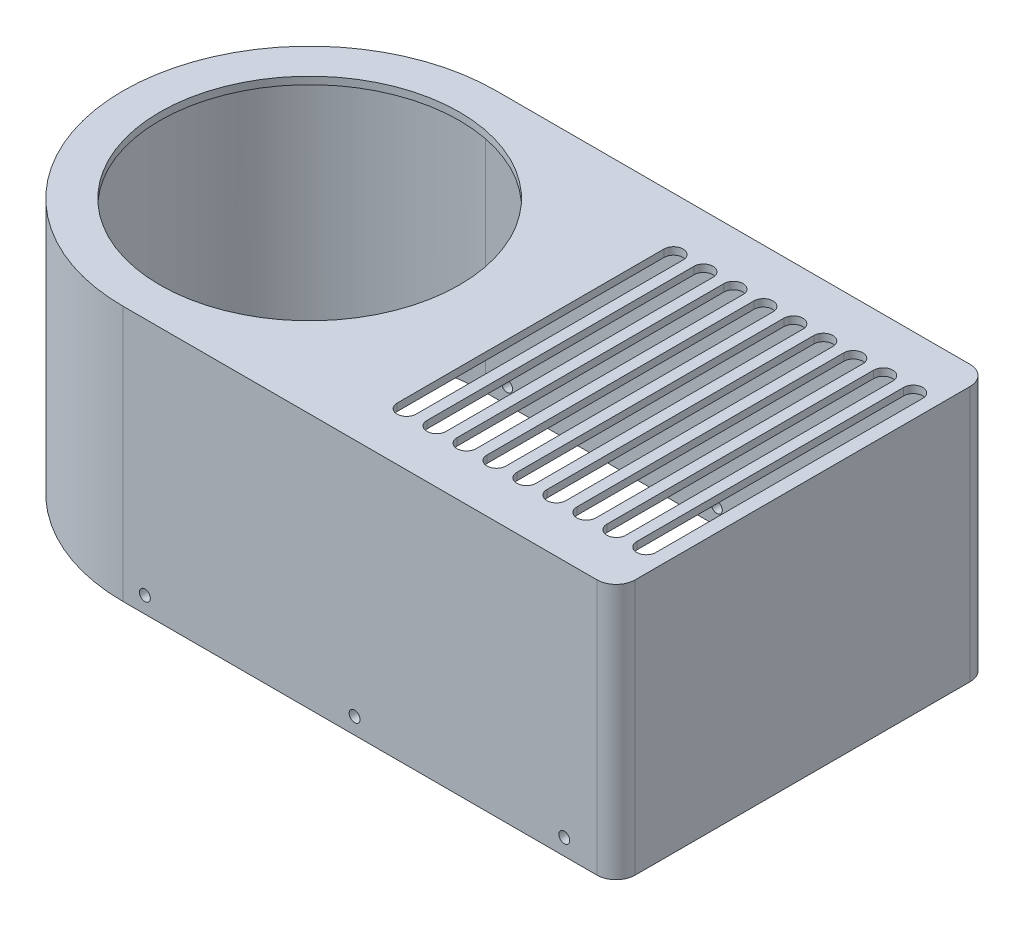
ISO-10303-21;
HEADER;
FILE_DESCRIPTION(('STEP AP214'),'2;1');
FILE_NAME('part.step','',(''),(''),'','','');
FILE_SCHEMA(('AUTOMOTIVE_DESIGN { 1 0 10303 214 1 1 1 1 }'));
ENDSEC;
DATA;
#1=APPLICATION_CONTEXT('core data for automotive mechanical design processes');
#2=APPLICATION_PROTOCOL_DEFINITION('international standard','automotive_design',2000,#1);
#3=PRODUCT_CONTEXT('',#1,'mechanical');
#4=PRODUCT('Part','Part','',(#3));
#5=PRODUCT_RELATED_PRODUCT_CATEGORY('part','',(#4));
#6=PRODUCT_DEFINITION_FORMATION('','',#4);
#7=PRODUCT_DEFINITION_CONTEXT('part definition',#1,'design');
#8=PRODUCT_DEFINITION('design','',#6,#7);
#9=PRODUCT_DEFINITION_SHAPE('','',#8);
#10=(LENGTH_UNIT() NAMED_UNIT(*) SI_UNIT(.MILLI.,.METRE.));
#11=(NAMED_UNIT(*) PLANE_ANGLE_UNIT() SI_UNIT($,.RADIAN.));
#12=(NAMED_UNIT(*) SI_UNIT($,.STERADIAN.) SOLID_ANGLE_UNIT());
#13=UNCERTAINTY_MEASURE_WITH_UNIT(LENGTH_MEASURE(1.E-05),#10,'distance_accuracy_value','');
#14=(GEOMETRIC_REPRESENTATION_CONTEXT(3) GLOBAL_UNCERTAINTY_ASSIGNED_CONTEXT((#13)) GLOBAL_UNIT_ASSIGNED_CONTEXT((#10,
#11,#12)) REPRESENTATION_CONTEXT('',''));
#15=CARTESIAN_POINT('',(0.,0.,0.));
#16=DIRECTION('',(0.,0.,1.));
#17=DIRECTION('',(1.,0.,0.));
#18=AXIS2_PLACEMENT_3D('',#15,#16,#17);
#19=CARTESIAN_POINT('',(0.,93.9,64.5));
#20=DIRECTION('',(0.,0.,-1.));
#21=DIRECTION('',(-1.,0.,0.));
#22=AXIS2_PLACEMENT_3D('',#19,#20,#21);
#23=PLANE('',#22);
#24=CARTESIAN_POINT('',(8.00000000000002,6.,64.5));
#25=DIRECTION('',(0.,0.,-1.));
#26=DIRECTION('',(-1.,0.,0.));
#27=AXIS2_PLACEMENT_3D('',#24,#25,#26);
#28=CIRCLE('',#27,2.);
#29=CARTESIAN_POINT('',(6.00000000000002,6.,64.5));
#30=VERTEX_POINT('',#29);
#31=EDGE_CURVE('E413',#30,#30,#28,.T.);
#32=ORIENTED_EDGE('',*,*,#31,.F.);
#33=EDGE_LOOP('',(#32));
#34=FACE_BOUND('',#33,.T.);
#35=CARTESIAN_POINT('',(162.,6.,64.5));
#36=DIRECTION('',(0.,0.,-1.));
#37=DIRECTION('',(-1.,0.,0.));
#38=AXIS2_PLACEMENT_3D('',#35,#36,#37);
#39=CIRCLE('',#38,2.);
#40=CARTESIAN_POINT('',(160.,6.,64.5));
#41=VERTEX_POINT('',#40);
#42=EDGE_CURVE('E1281',#41,#41,#39,.T.);
#43=ORIENTED_EDGE('',*,*,#42,.F.);
#44=EDGE_LOOP('',(#43));
#45=FACE_BOUND('',#44,.T.);
#46=CARTESIAN_POINT('',(85.,6.,64.5));
#47=DIRECTION('',(0.,0.,-1.));
#48=DIRECTION('',(-1.,0.,0.));
#49=AXIS2_PLACEMENT_3D('',#46,#47,#48);
#50=CIRCLE('',#49,2.);
#51=CARTESIAN_POINT('',(83.,6.,64.5));
#52=VERTEX_POINT('',#51);
#53=EDGE_CURVE('E1253',#52,#52,#50,.T.);
#54=ORIENTED_EDGE('',*,*,#53,.F.);
#55=EDGE_LOOP('',(#54));
#56=FACE_BOUND('',#55,.T.);
#57=DIRECTION('',(-1.,0.,0.));
#58=VECTOR('',#57,1.);
#59=CARTESIAN_POINT('',(0.,84.2,64.5));
#60=LINE('',#59,#58);
#61=CARTESIAN_POINT('',(21.8485697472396,84.2,64.5));
#62=VERTEX_POINT('',#61);
#63=CARTESIAN_POINT('',(7.19444229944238,84.2,64.5));
#64=VERTEX_POINT('',#63);
#65=EDGE_CURVE('E393',#62,#64,#60,.T.);
#66=ORIENTED_EDGE('',*,*,#65,.F.);
#67=CARTESIAN_POINT('',(21.8485697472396,84.2,64.5));
#68=CARTESIAN_POINT('',(22.0518068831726,84.2652132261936,64.5));
#69=CARTESIAN_POINT('',(22.2548050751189,84.331153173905,64.5));
#70=CARTESIAN_POINT('',(22.6603235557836,84.4644865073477,64.5));
#71=CARTESIAN_POINT('',(22.8628438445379,84.5318798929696,64.5));
#72=CARTESIAN_POINT('',(23.0651251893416,84.6,64.5));
#73=B_SPLINE_CURVE_WITH_KNOTS('',3,(#67,#68,#69,#70,#71,#72),.UNSPECIFIED.,.F.,.F.,(4,2,4),(0.,
0.64031795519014,1.28063586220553),.UNSPECIFIED.);
#74=CARTESIAN_POINT('',(23.0651251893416,84.6,64.5));
#75=VERTEX_POINT('',#74);
#76=EDGE_CURVE('E387',#62,#75,#73,.T.);
#77=ORIENTED_EDGE('',*,*,#76,.T.);
#78=DIRECTION('',(0.,1.,0.));
#79=VECTOR('',#78,1.);
#80=CARTESIAN_POINT('',(23.0651251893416,84.2,64.5));
#81=LINE('',#80,#79);
#82=CARTESIAN_POINT('',(23.0651251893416,91.2,64.5));
#83=VERTEX_POINT('',#82);
#84=EDGE_CURVE('E381',#75,#83,#81,.T.);
#85=ORIENTED_EDGE('',*,*,#84,.T.);
#86=DIRECTION('',(1.,0.,0.));
#87=VECTOR('',#86,1.);
#88=CARTESIAN_POINT('',(0.,91.2,64.5));
#89=LINE('',#88,#87);
#90=CARTESIAN_POINT('',(170.,91.2,64.5));
#91=VERTEX_POINT('',#90);
#92=EDGE_CURVE('E385',#83,#91,#89,.T.);
#93=ORIENTED_EDGE('',*,*,#92,.T.);
#94=DIRECTION('',(0.,-1.,0.));
#95=VECTOR('',#94,1.);
#96=CARTESIAN_POINT('',(170.,0.,64.5));
#97=LINE('',#96,#95);
#98=CARTESIAN_POINT('',(170.,0.,64.5));
#99=VERTEX_POINT('',#98);
#100=EDGE_CURVE('E776',#91,#99,#97,.T.);
#101=ORIENTED_EDGE('',*,*,#100,.T.);
#102=DIRECTION('',(1.,0.,0.));
#103=VECTOR('',#102,1.);
#104=CARTESIAN_POINT('',(0.,0.,64.5));
#105=LINE('',#104,#103);
#106=CARTESIAN_POINT('',(0.,0.,64.5));
#107=VERTEX_POINT('',#106);
#108=EDGE_CURVE('E696',#107,#99,#105,.T.);
#109=ORIENTED_EDGE('',*,*,#108,.F.);
#110=DIRECTION('',(0.,-1.,0.));
#111=VECTOR('',#110,1.);
#112=CARTESIAN_POINT('',(0.,93.9,64.5));
#113=LINE('',#112,#111);
#114=CARTESIAN_POINT('',(0.,84.6000000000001,64.5));
#115=VERTEX_POINT('',#114);
#116=EDGE_CURVE('E77',#115,#107,#113,.T.);
#117=ORIENTED_EDGE('',*,*,#116,.F.);
#118=CARTESIAN_POINT('',(0.,84.6000000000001,64.5));
#119=CARTESIAN_POINT('',(0.601002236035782,84.600015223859,64.5));
#120=CARTESIAN_POINT('',(1.20200212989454,84.5915999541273,64.5));
#121=CARTESIAN_POINT('',(2.40307570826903,84.5580355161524,64.5));
#122=CARTESIAN_POINT('',(3.00314974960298,84.5328991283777,64.5));
#123=CARTESIAN_POINT('',(4.20236423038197,84.4660194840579,64.5));
#124=CARTESIAN_POINT('',(4.80150467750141,84.4242763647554,64.5));
#125=CARTESIAN_POINT('',(5.9988786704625,84.3243880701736,64.5));
#126=CARTESIAN_POINT('',(6.59711117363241,84.2662303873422,64.5));
#127=CARTESIAN_POINT('',(7.19444229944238,84.2,64.5));
#128=B_SPLINE_CURVE_WITH_KNOTS('',3,(#118,#119,#120,#121,#122,#123,#124,#125,#126,#127),
.UNSPECIFIED.,.F.,.F.,(4,2,2,2,4),(0.,1.80294421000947,3.6045119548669,5.40606481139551,
7.20899413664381),.UNSPECIFIED.);
#129=EDGE_CURVE('E11',#115,#64,#128,.T.);
#130=ORIENTED_EDGE('',*,*,#129,.T.);
#131=EDGE_LOOP('',(#66,#77,#85,#93,#101,#109,#117,#130));
#132=FACE_BOUND('',#131,.T.);
#133=ADVANCED_FACE('F47',(#34,#45,#56,#132),#23,.T.);
#134=CARTESIAN_POINT('',(0.,93.9,-64.5));
#135=DIRECTION('',(0.,0.,1.));
#136=DIRECTION('',(1.,0.,0.));
#137=AXIS2_PLACEMENT_3D('',#134,#135,#136);
#138=PLANE('',#137);
#139=CARTESIAN_POINT('',(8.00000000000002,6.,-64.5));
#140=DIRECTION('',(0.,0.,1.));
#141=DIRECTION('',(1.,0.,0.));
#142=AXIS2_PLACEMENT_3D('',#139,#140,#141);
#143=CIRCLE('',#142,2.);
#144=CARTESIAN_POINT('',(6.00000000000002,6.,-64.5));
#145=VERTEX_POINT('',#144);
#146=EDGE_CURVE('E420',#145,#145,#143,.T.);
#147=ORIENTED_EDGE('',*,*,#146,.F.);
#148=EDGE_LOOP('',(#147));
#149=FACE_BOUND('',#148,.T.);
#150=CARTESIAN_POINT('',(162.,6.,-64.5));
#151=DIRECTION('',(0.,0.,1.));
#152=DIRECTION('',(1.,0.,0.));
#153=AXIS2_PLACEMENT_3D('',#150,#151,#152);
#154=CIRCLE('',#153,2.);
#155=CARTESIAN_POINT('',(160.,6.,-64.5));
#156=VERTEX_POINT('',#155);
#157=EDGE_CURVE('E1277',#156,#156,#154,.T.);
#158=ORIENTED_EDGE('',*,*,#157,.F.);
#159=EDGE_LOOP('',(#158));
#160=FACE_BOUND('',#159,.T.);
#161=CARTESIAN_POINT('',(85.,6.,-64.5));
#162=DIRECTION('',(0.,0.,1.));
#163=DIRECTION('',(1.,0.,0.));
#164=AXIS2_PLACEMENT_3D('',#161,#162,#163);
#165=CIRCLE('',#164,2.);
#166=CARTESIAN_POINT('',(83.,6.,-64.5));
#167=VERTEX_POINT('',#166);
#168=EDGE_CURVE('E1247',#167,#167,#165,.T.);
#169=ORIENTED_EDGE('',*,*,#168,.F.);
#170=EDGE_LOOP('',(#169));
#171=FACE_BOUND('',#170,.T.);
#172=DIRECTION('',(-1.,0.,0.));
#173=VECTOR('',#172,1.);
#174=CARTESIAN_POINT('',(177.,91.2,-64.5));
#175=LINE('',#174,#173);
#176=CARTESIAN_POINT('',(170.,91.2,-64.5));
#177=VERTEX_POINT('',#176);
#178=CARTESIAN_POINT('',(23.0651251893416,91.2,-64.5));
#179=VERTEX_POINT('',#178);
#180=EDGE_CURVE('E689',#177,#179,#175,.T.);
#181=ORIENTED_EDGE('',*,*,#180,.T.);
#182=DIRECTION('',(0.,1.,0.));
#183=VECTOR('',#182,1.);
#184=CARTESIAN_POINT('',(23.0651251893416,84.2,-64.5));
#185=LINE('',#184,#183);
#186=CARTESIAN_POINT('',(23.0651251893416,84.6,-64.5));
#187=VERTEX_POINT('',#186);
#188=EDGE_CURVE('E392',#187,#179,#185,.T.);
#189=ORIENTED_EDGE('',*,*,#188,.F.);
#190=CARTESIAN_POINT('',(23.0651251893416,84.6,-64.5));
#191=CARTESIAN_POINT('',(22.8628438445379,84.5318798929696,-64.5));
#192=CARTESIAN_POINT('',(22.6603235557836,84.4644865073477,-64.5));
#193=CARTESIAN_POINT('',(22.2548050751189,84.331153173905,-64.5));
#194=CARTESIAN_POINT('',(22.0518068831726,84.2652132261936,-64.5));
#195=CARTESIAN_POINT('',(21.8485697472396,84.2,-64.5));
#196=B_SPLINE_CURVE_WITH_KNOTS('',3,(#190,#191,#192,#193,#194,#195),.UNSPECIFIED.,.F.,.F.,(4,2,
4),(0.,0.640317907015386,1.28063586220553),.UNSPECIFIED.);
#197=CARTESIAN_POINT('',(21.8485697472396,84.2,-64.5));
#198=VERTEX_POINT('',#197);
#199=EDGE_CURVE('E967',#187,#198,#196,.T.);
#200=ORIENTED_EDGE('',*,*,#199,.T.);
#201=DIRECTION('',(1.,0.,0.));
#202=VECTOR('',#201,1.);
#203=CARTESIAN_POINT('',(0.,84.2,-64.5));
#204=LINE('',#203,#202);
#205=CARTESIAN_POINT('',(7.19444229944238,84.2,-64.5));
#206=VERTEX_POINT('',#205);
#207=EDGE_CURVE('E412',#206,#198,#204,.T.);
#208=ORIENTED_EDGE('',*,*,#207,.F.);
#209=CARTESIAN_POINT('',(7.19444229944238,84.2,-64.5));
#210=CARTESIAN_POINT('',(6.59711117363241,84.2662303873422,-64.5));
#211=CARTESIAN_POINT('',(5.9988786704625,84.3243880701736,-64.5));
#212=CARTESIAN_POINT('',(4.80150467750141,84.4242763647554,-64.5));
#213=CARTESIAN_POINT('',(4.20236423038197,84.4660194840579,-64.5));
#214=CARTESIAN_POINT('',(3.00314974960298,84.5328991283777,-64.5));
#215=CARTESIAN_POINT('',(2.40307570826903,84.5580355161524,-64.5));
#216=CARTESIAN_POINT('',(1.20200212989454,84.5915999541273,-64.5));
#217=CARTESIAN_POINT('',(0.601002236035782,84.600015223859,-64.5));
#218=CARTESIAN_POINT('',(0.,84.6000000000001,-64.5));
#219=B_SPLINE_CURVE_WITH_KNOTS('',3,(#209,#210,#211,#212,#213,#214,#215,#216,#217,#218),
.UNSPECIFIED.,.F.,.F.,(4,2,2,2,4),(0.,1.80292932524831,3.60448218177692,5.40604992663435,
7.20899413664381),.UNSPECIFIED.);
#220=CARTESIAN_POINT('',(0.,84.6000000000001,-64.5));
#221=VERTEX_POINT('',#220);
#222=EDGE_CURVE('E63',#206,#221,#219,.T.);
#223=ORIENTED_EDGE('',*,*,#222,.T.);
#224=DIRECTION('',(0.,-1.,0.));
#225=VECTOR('',#224,1.);
#226=CARTESIAN_POINT('',(0.,93.9,-64.5));
#227=LINE('',#226,#225);
#228=CARTESIAN_POINT('',(0.,0.,-64.5));
#229=VERTEX_POINT('',#228);
#230=EDGE_CURVE('E70',#221,#229,#227,.T.);
#231=ORIENTED_EDGE('',*,*,#230,.T.);
#232=DIRECTION('',(-1.,0.,0.));
#233=VECTOR('',#232,1.);
#234=CARTESIAN_POINT('',(0.,0.,-64.5));
#235=LINE('',#234,#233);
#236=CARTESIAN_POINT('',(170.,0.,-64.5));
#237=VERTEX_POINT('',#236);
#238=EDGE_CURVE('E704',#237,#229,#235,.T.);
#239=ORIENTED_EDGE('',*,*,#238,.F.);
#240=DIRECTION('',(0.,-1.,0.));
#241=VECTOR('',#240,1.);
#242=CARTESIAN_POINT('',(170.,91.2,-64.5));
#243=LINE('',#242,#241);
#244=EDGE_CURVE('E791',#237,#177,#243,.F.);
#245=ORIENTED_EDGE('',*,*,#244,.T.);
#246=EDGE_LOOP('',(#181,#189,#200,#208,#223,#231,#239,#245));
#247=FACE_BOUND('',#246,.T.);
#248=ADVANCED_FACE('F981',(#149,#160,#171,#247),#138,.T.);
#249=CARTESIAN_POINT('',(0.,91.2,0.));
#250=DIRECTION('',(0.,1.,0.));
#251=DIRECTION('',(0.,0.,1.));
#252=AXIS2_PLACEMENT_3D('',#249,#250,#251);
#253=PLANE('',#252);
#254=CARTESIAN_POINT('',(0.,91.2,0.));
#255=DIRECTION('',(0.,1.,0.));
#256=DIRECTION('',(0.,0.,1.));
#257=AXIS2_PLACEMENT_3D('',#254,#255,#256);
#258=CIRCLE('',#257,55.);
#259=CARTESIAN_POINT('',(0.,91.2,55.));
#260=VERTEX_POINT('',#259);
#261=EDGE_CURVE('E431',#260,#260,#258,.T.);
#262=ORIENTED_EDGE('',*,*,#261,.T.);
#263=EDGE_LOOP('',(#262));
#264=FACE_BOUND('',#263,.T.);
#265=CARTESIAN_POINT('',(0.,91.2,0.));
#266=DIRECTION('',(0.,1.,0.));
#267=DIRECTION('',(0.,0.,1.));
#268=AXIS2_PLACEMENT_3D('',#265,#266,#267);
#269=CIRCLE('',#268,64.5);
#270=CARTESIAN_POINT('',(0.,91.2,64.5));
#271=VERTEX_POINT('',#270);
#272=EDGE_CURVE('E407',#271,#271,#269,.T.);
#273=ORIENTED_EDGE('',*,*,#272,.F.);
#274=EDGE_LOOP('',(#273));
#275=FACE_BOUND('',#274,.T.);
#276=ADVANCED_FACE('F1062',(#264,#275),#253,.F.);
#277=DIRECTION('',(0.,0.,1.));
#278=VECTOR('',#277,1.);
#279=CARTESIAN_POINT('',(81.1,91.2,0.));
#280=LINE('',#279,#278);
#281=CARTESIAN_POINT('',(81.1,91.2,-49.));
#282=VERTEX_POINT('',#281);
#283=CARTESIAN_POINT('',(81.1,91.2,49.));
#284=VERTEX_POINT('',#283);
#285=EDGE_CURVE('E808',#282,#284,#280,.T.);
#286=ORIENTED_EDGE('',*,*,#285,.T.);
#287=CARTESIAN_POINT('',(84.6,91.2,49.));
#288=DIRECTION('',(0.,1.,0.));
#289=DIRECTION('',(0.,0.,1.));
#290=AXIS2_PLACEMENT_3D('',#287,#288,#289);
#291=CIRCLE('',#290,3.5);
#292=CARTESIAN_POINT('',(88.1,91.2,49.));
#293=VERTEX_POINT('',#292);
#294=EDGE_CURVE('E812',#284,#293,#291,.T.);
#295=ORIENTED_EDGE('',*,*,#294,.T.);
#296=DIRECTION('',(0.,0.,-1.));
#297=VECTOR('',#296,1.);
#298=CARTESIAN_POINT('',(88.1,91.2,0.));
#299=LINE('',#298,#297);
#300=CARTESIAN_POINT('',(88.1,91.2,-49.));
#301=VERTEX_POINT('',#300);
#302=EDGE_CURVE('E800',#293,#301,#299,.T.);
#303=ORIENTED_EDGE('',*,*,#302,.T.);
#304=CARTESIAN_POINT('',(84.6,91.2,-49.));
#305=DIRECTION('',(0.,1.,0.));
#306=DIRECTION('',(0.,0.,1.));
#307=AXIS2_PLACEMENT_3D('',#304,#305,#306);
#308=CIRCLE('',#307,3.5);
#309=EDGE_CURVE('E804',#301,#282,#308,.T.);
#310=ORIENTED_EDGE('',*,*,#309,.T.);
#311=EDGE_LOOP('',(#286,#295,#303,#310));
#312=FACE_BOUND('',#311,.T.);
#313=DIRECTION('',(0.,0.,1.));
#314=VECTOR('',#313,1.);
#315=CARTESIAN_POINT('',(92.0999999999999,91.2,0.));
#316=LINE('',#315,#314);
#317=CARTESIAN_POINT('',(92.0999999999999,91.2,-49.));
#318=VERTEX_POINT('',#317);
#319=CARTESIAN_POINT('',(92.0999999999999,91.2,49.));
#320=VERTEX_POINT('',#319);
#321=EDGE_CURVE('E824',#318,#320,#316,.T.);
#322=ORIENTED_EDGE('',*,*,#321,.T.);
#323=CARTESIAN_POINT('',(95.5999999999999,91.2,49.));
#324=DIRECTION('',(0.,1.,0.));
#325=DIRECTION('',(0.,0.,1.));
#326=AXIS2_PLACEMENT_3D('',#323,#324,#325);
#327=CIRCLE('',#326,3.5);
#328=CARTESIAN_POINT('',(99.0999999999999,91.2,49.));
#329=VERTEX_POINT('',#328);
#330=EDGE_CURVE('E828',#320,#329,#327,.T.);
#331=ORIENTED_EDGE('',*,*,#330,.T.);
#332=DIRECTION('',(0.,0.,-1.));
#333=VECTOR('',#332,1.);
#334=CARTESIAN_POINT('',(99.0999999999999,91.2,0.));
#335=LINE('',#334,#333);
#336=CARTESIAN_POINT('',(99.0999999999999,91.2,-49.));
#337=VERTEX_POINT('',#336);
#338=EDGE_CURVE('E816',#329,#337,#335,.T.);
#339=ORIENTED_EDGE('',*,*,#338,.T.);
#340=CARTESIAN_POINT('',(95.5999999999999,91.2,-49.));
#341=DIRECTION('',(0.,1.,0.));
#342=DIRECTION('',(0.,0.,1.));
#343=AXIS2_PLACEMENT_3D('',#340,#341,#342);
#344=CIRCLE('',#343,3.5);
#345=EDGE_CURVE('E820',#337,#318,#344,.T.);
#346=ORIENTED_EDGE('',*,*,#345,.T.);
#347=EDGE_LOOP('',(#322,#331,#339,#346));
#348=FACE_BOUND('',#347,.T.);
#349=DIRECTION('',(0.,0.,-1.));
#350=VECTOR('',#349,1.);
#351=CARTESIAN_POINT('',(110.1,91.2,0.));
#352=LINE('',#351,#350);
#353=CARTESIAN_POINT('',(110.1,91.2,49.));
#354=VERTEX_POINT('',#353);
#355=CARTESIAN_POINT('',(110.1,91.2,-49.));
#356=VERTEX_POINT('',#355);
#357=EDGE_CURVE('E840',#354,#356,#352,.T.);
#358=ORIENTED_EDGE('',*,*,#357,.T.);
#359=CARTESIAN_POINT('',(106.6,91.2,-49.));
#360=DIRECTION('',(0.,1.,0.));
#361=DIRECTION('',(0.,0.,1.));
#362=AXIS2_PLACEMENT_3D('',#359,#360,#361);
#363=CIRCLE('',#362,3.50000000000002);
#364=CARTESIAN_POINT('',(103.1,91.2,-49.));
#365=VERTEX_POINT('',#364);
#366=EDGE_CURVE('E844',#356,#365,#363,.T.);
#367=ORIENTED_EDGE('',*,*,#366,.T.);
#368=DIRECTION('',(0.,0.,1.));
#369=VECTOR('',#368,1.);
#370=CARTESIAN_POINT('',(103.1,91.2,0.));
#371=LINE('',#370,#369);
#372=CARTESIAN_POINT('',(103.1,91.2,49.));
#373=VERTEX_POINT('',#372);
#374=EDGE_CURVE('E832',#365,#373,#371,.T.);
#375=ORIENTED_EDGE('',*,*,#374,.T.);
#376=CARTESIAN_POINT('',(106.6,91.2,49.));
#377=DIRECTION('',(0.,1.,0.));
#378=DIRECTION('',(0.,0.,1.));
#379=AXIS2_PLACEMENT_3D('',#376,#377,#378);
#380=CIRCLE('',#379,3.50000000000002);
#381=EDGE_CURVE('E836',#373,#354,#380,.T.);
#382=ORIENTED_EDGE('',*,*,#381,.T.);
#383=EDGE_LOOP('',(#358,#367,#375,#382));
#384=FACE_BOUND('',#383,.T.);
#385=DIRECTION('',(0.,0.,-1.));
#386=VECTOR('',#385,1.);
#387=CARTESIAN_POINT('',(121.1,91.2,0.));
#388=LINE('',#387,#386);
#389=CARTESIAN_POINT('',(121.1,91.2,49.));
#390=VERTEX_POINT('',#389);
#391=CARTESIAN_POINT('',(121.1,91.2,-49.));
#392=VERTEX_POINT('',#391);
#393=EDGE_CURVE('E856',#390,#392,#388,.T.);
#394=ORIENTED_EDGE('',*,*,#393,.T.);
#395=CARTESIAN_POINT('',(117.6,91.2,-49.));
#396=DIRECTION('',(0.,1.,0.));
#397=DIRECTION('',(0.,0.,1.));
#398=AXIS2_PLACEMENT_3D('',#395,#396,#397);
#399=CIRCLE('',#398,3.50000000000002);
#400=CARTESIAN_POINT('',(114.1,91.2,-49.));
#401=VERTEX_POINT('',#400);
#402=EDGE_CURVE('E860',#392,#401,#399,.T.);
#403=ORIENTED_EDGE('',*,*,#402,.T.);
#404=DIRECTION('',(0.,0.,1.));
#405=VECTOR('',#404,1.);
#406=CARTESIAN_POINT('',(114.1,91.2,0.));
#407=LINE('',#406,#405);
#408=CARTESIAN_POINT('',(114.1,91.2,49.));
#409=VERTEX_POINT('',#408);
#410=EDGE_CURVE('E848',#401,#409,#407,.T.);
#411=ORIENTED_EDGE('',*,*,#410,.T.);
#412=CARTESIAN_POINT('',(117.6,91.2,49.));
#413=DIRECTION('',(0.,1.,0.));
#414=DIRECTION('',(0.,0.,1.));
#415=AXIS2_PLACEMENT_3D('',#412,#413,#414);
#416=CIRCLE('',#415,3.50000000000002);
#417=EDGE_CURVE('E852',#409,#390,#416,.T.);
#418=ORIENTED_EDGE('',*,*,#417,.T.);
#419=EDGE_LOOP('',(#394,#403,#411,#418));
#420=FACE_BOUND('',#419,.T.);
#421=DIRECTION('',(0.,0.,-1.));
#422=VECTOR('',#421,1.);
#423=CARTESIAN_POINT('',(132.1,91.2,0.));
#424=LINE('',#423,#422);
#425=CARTESIAN_POINT('',(132.1,91.2,49.));
#426=VERTEX_POINT('',#425);
#427=CARTESIAN_POINT('',(132.1,91.2,-49.));
#428=VERTEX_POINT('',#427);
#429=EDGE_CURVE('E872',#426,#428,#424,.T.);
#430=ORIENTED_EDGE('',*,*,#429,.T.);
#431=CARTESIAN_POINT('',(128.6,91.2,-49.));
#432=DIRECTION('',(0.,1.,0.));
#433=DIRECTION('',(0.,0.,1.));
#434=AXIS2_PLACEMENT_3D('',#431,#432,#433);
#435=CIRCLE('',#434,3.49999999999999);
#436=CARTESIAN_POINT('',(125.1,91.2,-49.));
#437=VERTEX_POINT('',#436);
#438=EDGE_CURVE('E876',#428,#437,#435,.T.);
#439=ORIENTED_EDGE('',*,*,#438,.T.);
#440=DIRECTION('',(0.,0.,1.));
#441=VECTOR('',#440,1.);
#442=CARTESIAN_POINT('',(125.1,91.2,0.));
#443=LINE('',#442,#441);
#444=CARTESIAN_POINT('',(125.1,91.2,49.));
#445=VERTEX_POINT('',#444);
#446=EDGE_CURVE('E864',#437,#445,#443,.T.);
#447=ORIENTED_EDGE('',*,*,#446,.T.);
#448=CARTESIAN_POINT('',(128.6,91.2,49.));
#449=DIRECTION('',(0.,1.,0.));
#450=DIRECTION('',(0.,0.,1.));
#451=AXIS2_PLACEMENT_3D('',#448,#449,#450);
#452=CIRCLE('',#451,3.49999999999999);
#453=EDGE_CURVE('E868',#445,#426,#452,.T.);
#454=ORIENTED_EDGE('',*,*,#453,.T.);
#455=EDGE_LOOP('',(#430,#439,#447,#454));
#456=FACE_BOUND('',#455,.T.);
#457=DIRECTION('',(0.,0.,-1.));
#458=VECTOR('',#457,1.);
#459=CARTESIAN_POINT('',(176.1,91.2,0.));
#460=LINE('',#459,#458);
#461=CARTESIAN_POINT('',(176.1,91.2,49.));
#462=VERTEX_POINT('',#461);
#463=CARTESIAN_POINT('',(176.1,91.2,-49.));
#464=VERTEX_POINT('',#463);
#465=EDGE_CURVE('E888',#462,#464,#460,.T.);
#466=ORIENTED_EDGE('',*,*,#465,.T.);
#467=CARTESIAN_POINT('',(172.6,91.2,-49.));
#468=DIRECTION('',(0.,1.,0.));
#469=DIRECTION('',(0.,0.,1.));
#470=AXIS2_PLACEMENT_3D('',#467,#468,#469);
#471=CIRCLE('',#470,3.50000000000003);
#472=CARTESIAN_POINT('',(169.1,91.2,-49.));
#473=VERTEX_POINT('',#472);
#474=EDGE_CURVE('E892',#464,#473,#471,.T.);
#475=ORIENTED_EDGE('',*,*,#474,.T.);
#476=DIRECTION('',(0.,0.,1.));
#477=VECTOR('',#476,1.);
#478=CARTESIAN_POINT('',(169.1,91.2,0.));
#479=LINE('',#478,#477);
#480=CARTESIAN_POINT('',(169.1,91.2,49.));
#481=VERTEX_POINT('',#480);
#482=EDGE_CURVE('E880',#473,#481,#479,.T.);
#483=ORIENTED_EDGE('',*,*,#482,.T.);
#484=CARTESIAN_POINT('',(172.6,91.2,49.));
#485=DIRECTION('',(0.,1.,0.));
#486=DIRECTION('',(0.,0.,1.));
#487=AXIS2_PLACEMENT_3D('',#484,#485,#486);
#488=CIRCLE('',#487,3.50000000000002);
#489=EDGE_CURVE('E884',#481,#462,#488,.T.);
#490=ORIENTED_EDGE('',*,*,#489,.T.);
#491=EDGE_LOOP('',(#466,#475,#483,#490));
#492=FACE_BOUND('',#491,.T.);
#493=DIRECTION('',(0.,0.,-1.));
#494=VECTOR('',#493,1.);
#495=CARTESIAN_POINT('',(154.1,91.2,0.));
#496=LINE('',#495,#494);
#497=CARTESIAN_POINT('',(154.1,91.2,49.));
#498=VERTEX_POINT('',#497);
#499=CARTESIAN_POINT('',(154.1,91.2,-49.));
#500=VERTEX_POINT('',#499);
#501=EDGE_CURVE('E904',#498,#500,#496,.T.);
#502=ORIENTED_EDGE('',*,*,#501,.T.);
#503=CARTESIAN_POINT('',(150.6,91.2,-49.));
#504=DIRECTION('',(0.,1.,0.));
#505=DIRECTION('',(0.,0.,1.));
#506=AXIS2_PLACEMENT_3D('',#503,#504,#505);
#507=CIRCLE('',#506,3.49999999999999);
#508=CARTESIAN_POINT('',(147.1,91.2,-49.));
#509=VERTEX_POINT('',#508);
#510=EDGE_CURVE('E908',#500,#509,#507,.T.);
#511=ORIENTED_EDGE('',*,*,#510,.T.);
#512=DIRECTION('',(0.,0.,1.));
#513=VECTOR('',#512,1.);
#514=CARTESIAN_POINT('',(147.1,91.2,0.));
#515=LINE('',#514,#513);
#516=CARTESIAN_POINT('',(147.1,91.2,49.));
#517=VERTEX_POINT('',#516);
#518=EDGE_CURVE('E896',#509,#517,#515,.T.);
#519=ORIENTED_EDGE('',*,*,#518,.T.);
#520=CARTESIAN_POINT('',(150.6,91.2,49.));
#521=DIRECTION('',(0.,1.,0.));
#522=DIRECTION('',(0.,0.,1.));
#523=AXIS2_PLACEMENT_3D('',#520,#521,#522);
#524=CIRCLE('',#523,3.49999999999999);
#525=EDGE_CURVE('E900',#517,#498,#524,.T.);
#526=ORIENTED_EDGE('',*,*,#525,.T.);
#527=EDGE_LOOP('',(#502,#511,#519,#526));
#528=FACE_BOUND('',#527,.T.);
#529=DIRECTION('',(0.,0.,-1.));
#530=VECTOR('',#529,1.);
#531=CARTESIAN_POINT('',(165.1,91.2,0.));
#532=LINE('',#531,#530);
#533=CARTESIAN_POINT('',(165.1,91.2,49.));
#534=VERTEX_POINT('',#533);
#535=CARTESIAN_POINT('',(165.1,91.2,-49.));
#536=VERTEX_POINT('',#535);
#537=EDGE_CURVE('E920',#534,#536,#532,.T.);
#538=ORIENTED_EDGE('',*,*,#537,.T.);
#539=CARTESIAN_POINT('',(161.6,91.2,-49.));
#540=DIRECTION('',(0.,1.,0.));
#541=DIRECTION('',(0.,0.,1.));
#542=AXIS2_PLACEMENT_3D('',#539,#540,#541);
#543=CIRCLE('',#542,3.50000000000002);
#544=CARTESIAN_POINT('',(158.1,91.2,-49.));
#545=VERTEX_POINT('',#544);
#546=EDGE_CURVE('E924',#536,#545,#543,.T.);
#547=ORIENTED_EDGE('',*,*,#546,.T.);
#548=DIRECTION('',(0.,0.,1.));
#549=VECTOR('',#548,1.);
#550=CARTESIAN_POINT('',(158.1,91.2,0.));
#551=LINE('',#550,#549);
#552=CARTESIAN_POINT('',(158.1,91.2,49.));
#553=VERTEX_POINT('',#552);
#554=EDGE_CURVE('E912',#545,#553,#551,.T.);
#555=ORIENTED_EDGE('',*,*,#554,.T.);
#556=CARTESIAN_POINT('',(161.6,91.2,49.));
#557=DIRECTION('',(0.,1.,0.));
#558=DIRECTION('',(0.,0.,1.));
#559=AXIS2_PLACEMENT_3D('',#556,#557,#558);
#560=CIRCLE('',#559,3.50000000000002);
#561=EDGE_CURVE('E916',#553,#534,#560,.T.);
#562=ORIENTED_EDGE('',*,*,#561,.T.);
#563=EDGE_LOOP('',(#538,#547,#555,#562));
#564=FACE_BOUND('',#563,.T.);
#565=DIRECTION('',(0.,0.,-1.));
#566=VECTOR('',#565,1.);
#567=CARTESIAN_POINT('',(143.1,91.2,0.));
#568=LINE('',#567,#566);
#569=CARTESIAN_POINT('',(143.1,91.2,49.));
#570=VERTEX_POINT('',#569);
#571=CARTESIAN_POINT('',(143.1,91.2,-49.));
#572=VERTEX_POINT('',#571);
#573=EDGE_CURVE('E936',#570,#572,#568,.T.);
#574=ORIENTED_EDGE('',*,*,#573,.T.);
#575=CARTESIAN_POINT('',(139.6,91.2,-49.));
#576=DIRECTION('',(0.,1.,0.));
#577=DIRECTION('',(0.,0.,1.));
#578=AXIS2_PLACEMENT_3D('',#575,#576,#577);
#579=CIRCLE('',#578,3.49999999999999);
#580=CARTESIAN_POINT('',(136.1,91.2,-49.));
#581=VERTEX_POINT('',#580);
#582=EDGE_CURVE('E940',#572,#581,#579,.T.);
#583=ORIENTED_EDGE('',*,*,#582,.T.);
#584=DIRECTION('',(0.,0.,1.));
#585=VECTOR('',#584,1.);
#586=CARTESIAN_POINT('',(136.1,91.2,0.));
#587=LINE('',#586,#585);
#588=CARTESIAN_POINT('',(136.1,91.2,49.));
#589=VERTEX_POINT('',#588);
#590=EDGE_CURVE('E928',#581,#589,#587,.T.);
#591=ORIENTED_EDGE('',*,*,#590,.T.);
#592=CARTESIAN_POINT('',(139.6,91.2,49.));
#593=DIRECTION('',(0.,1.,0.));
#594=DIRECTION('',(0.,0.,1.));
#595=AXIS2_PLACEMENT_3D('',#592,#593,#594);
#596=CIRCLE('',#595,3.49999999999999);
#597=EDGE_CURVE('E932',#589,#570,#596,.T.);
#598=ORIENTED_EDGE('',*,*,#597,.T.);
#599=EDGE_LOOP('',(#574,#583,#591,#598));
#600=FACE_BOUND('',#599,.T.);
#601=CARTESIAN_POINT('',(0.,91.2,0.));
#602=DIRECTION('',(0.,-1.,0.));
#603=DIRECTION('',(0.,0.,-1.));
#604=AXIS2_PLACEMENT_3D('',#601,#602,#603);
#605=CIRCLE('',#604,68.5);
#606=EDGE_CURVE('E399',#179,#83,#605,.T.);
#607=ORIENTED_EDGE('',*,*,#606,.F.);
#608=ORIENTED_EDGE('',*,*,#180,.F.);
#609=CARTESIAN_POINT('',(170.,91.2,-57.5));
#610=DIRECTION('',(0.,1.,0.));
#611=DIRECTION('',(0.,0.,1.));
#612=AXIS2_PLACEMENT_3D('',#609,#610,#611);
#613=CIRCLE('',#612,7.);
#614=CARTESIAN_POINT('',(177.,91.2,-57.5));
#615=VERTEX_POINT('',#614);
#616=EDGE_CURVE('E786',#177,#615,#613,.F.);
#617=ORIENTED_EDGE('',*,*,#616,.T.);
#618=DIRECTION('',(0.,0.,-1.));
#619=VECTOR('',#618,1.);
#620=CARTESIAN_POINT('',(177.,91.2,64.5));
#621=LINE('',#620,#619);
#622=CARTESIAN_POINT('',(177.,91.2,57.5));
#623=VERTEX_POINT('',#622);
#624=EDGE_CURVE('E406',#623,#615,#621,.T.);
#625=ORIENTED_EDGE('',*,*,#624,.F.);
#626=CARTESIAN_POINT('',(170.,91.2,57.5));
#627=DIRECTION('',(0.,1.,0.));
#628=DIRECTION('',(0.,0.,1.));
#629=AXIS2_PLACEMENT_3D('',#626,#627,#628);
#630=CIRCLE('',#629,7.);
#631=EDGE_CURVE('E403',#623,#91,#630,.F.);
#632=ORIENTED_EDGE('',*,*,#631,.T.);
#633=ORIENTED_EDGE('',*,*,#92,.F.);
#634=EDGE_LOOP('',(#607,#608,#617,#625,#632,#633));
#635=FACE_BOUND('',#634,.T.);
#636=ADVANCED_FACE('F397',(#312,#348,#384,#420,#456,#492,#528,#564,#600,#635),#253,.F.);
#637=CARTESIAN_POINT('',(0.,93.9,0.));
#638=DIRECTION('',(0.,-1.,0.));
#639=DIRECTION('',(0.,0.,-1.));
#640=AXIS2_PLACEMENT_3D('',#637,#638,#639);
#641=CYLINDRICAL_SURFACE('',#640,64.5);
#642=ORIENTED_EDGE('',*,*,#230,.F.);
#643=CARTESIAN_POINT('',(0.,84.6000000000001,0.));
#644=DIRECTION('',(0.,-1.,0.));
#645=DIRECTION('',(0.,0.,-1.));
#646=AXIS2_PLACEMENT_3D('',#643,#644,#645);
#647=CIRCLE('',#646,64.5);
#648=EDGE_CURVE('E958',#221,#115,#647,.T.);
#649=ORIENTED_EDGE('',*,*,#648,.T.);
#650=ORIENTED_EDGE('',*,*,#116,.T.);
#651=CARTESIAN_POINT('',(0.,0.,0.));
#652=DIRECTION('',(0.,1.,0.));
#653=DIRECTION('',(0.,0.,1.));
#654=AXIS2_PLACEMENT_3D('',#651,#652,#653);
#655=CIRCLE('',#654,64.5);
#656=EDGE_CURVE('E692',#229,#107,#655,.T.);
#657=ORIENTED_EDGE('',*,*,#656,.F.);
#658=EDGE_LOOP('',(#642,#649,#650,#657));
#659=FACE_BOUND('',#658,.T.);
#660=ORIENTED_EDGE('',*,*,#272,.T.);
#661=EDGE_LOOP('',(#660));
#662=FACE_BOUND('',#661,.T.);
#663=ADVANCED_FACE('F984',(#659,#662),#641,.F.);
#664=CARTESIAN_POINT('',(177.,93.9,-64.5));
#665=DIRECTION('',(-1.,0.,0.));
#666=DIRECTION('',(0.,0.,1.));
#667=AXIS2_PLACEMENT_3D('',#664,#665,#666);
#668=PLANE('',#667);
#669=DIRECTION('',(0.,0.,-1.));
#670=VECTOR('',#669,1.);
#671=CARTESIAN_POINT('',(177.,0.,-64.5));
#672=LINE('',#671,#670);
#673=CARTESIAN_POINT('',(177.,0.,57.5));
#674=VERTEX_POINT('',#673);
#675=CARTESIAN_POINT('',(177.,0.,-57.5));
#676=VERTEX_POINT('',#675);
#677=EDGE_CURVE('E700',#674,#676,#672,.T.);
#678=ORIENTED_EDGE('',*,*,#677,.F.);
#679=DIRECTION('',(0.,-1.,0.));
#680=VECTOR('',#679,1.);
#681=CARTESIAN_POINT('',(177.,91.2,57.5));
#682=LINE('',#681,#680);
#683=EDGE_CURVE('E783',#674,#623,#682,.F.);
#684=ORIENTED_EDGE('',*,*,#683,.T.);
#685=ORIENTED_EDGE('',*,*,#624,.T.);
#686=DIRECTION('',(0.,-1.,0.));
#687=VECTOR('',#686,1.);
#688=CARTESIAN_POINT('',(177.,0.,-57.5));
#689=LINE('',#688,#687);
#690=EDGE_CURVE('E779',#615,#676,#689,.T.);
#691=ORIENTED_EDGE('',*,*,#690,.T.);
#692=EDGE_LOOP('',(#678,#684,#685,#691));
#693=FACE_BOUND('',#692,.T.);
#694=ADVANCED_FACE('F983',(#693),#668,.T.);
#695=CARTESIAN_POINT('',(0.,93.9,0.));
#696=DIRECTION('',(0.,-1.,0.));
#697=DIRECTION('',(0.,0.,-1.));
#698=AXIS2_PLACEMENT_3D('',#695,#696,#697);
#699=PLANE('',#698);
#700=CARTESIAN_POINT('',(0.,93.9,0.));
#701=DIRECTION('',(0.,1.,0.));
#702=DIRECTION('',(0.,0.,1.));
#703=AXIS2_PLACEMENT_3D('',#700,#701,#702);
#704=CIRCLE('',#703,55.);
#705=CARTESIAN_POINT('',(0.,93.9,55.));
#706=VERTEX_POINT('',#705);
#707=EDGE_CURVE('E427',#706,#706,#704,.T.);
#708=ORIENTED_EDGE('',*,*,#707,.F.);
#709=EDGE_LOOP('',(#708));
#710=FACE_BOUND('',#709,.T.);
#711=DIRECTION('',(0.,0.,1.));
#712=VECTOR('',#711,1.);
#713=CARTESIAN_POINT('',(136.1,93.9,-49.));
#714=LINE('',#713,#712);
#715=CARTESIAN_POINT('',(136.1,93.9,-49.));
#716=VERTEX_POINT('',#715);
#717=CARTESIAN_POINT('',(136.1,93.9,49.));
#718=VERTEX_POINT('',#717);
#719=EDGE_CURVE('E485',#716,#718,#714,.T.);
#720=ORIENTED_EDGE('',*,*,#719,.F.);
#721=CARTESIAN_POINT('',(139.6,93.9,-49.));
#722=DIRECTION('',(0.,1.,0.));
#723=DIRECTION('',(0.,0.,1.));
#724=AXIS2_PLACEMENT_3D('',#721,#722,#723);
#725=CIRCLE('',#724,3.49999999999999);
#726=CARTESIAN_POINT('',(143.1,93.9,-49.));
#727=VERTEX_POINT('',#726);
#728=EDGE_CURVE('E447',#727,#716,#725,.T.);
#729=ORIENTED_EDGE('',*,*,#728,.F.);
#730=DIRECTION('',(0.,0.,-1.));
#731=VECTOR('',#730,1.);
#732=CARTESIAN_POINT('',(143.1,93.9,-49.));
#733=LINE('',#732,#731);
#734=CARTESIAN_POINT('',(143.1,93.9,49.));
#735=VERTEX_POINT('',#734);
#736=EDGE_CURVE('E467',#735,#727,#733,.T.);
#737=ORIENTED_EDGE('',*,*,#736,.F.);
#738=CARTESIAN_POINT('',(139.6,93.9,49.));
#739=DIRECTION('',(0.,1.,0.));
#740=DIRECTION('',(0.,0.,1.));
#741=AXIS2_PLACEMENT_3D('',#738,#739,#740);
#742=CIRCLE('',#741,3.49999999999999);
#743=EDGE_CURVE('E481',#718,#735,#742,.T.);
#744=ORIENTED_EDGE('',*,*,#743,.F.);
#745=EDGE_LOOP('',(#720,#729,#737,#744));
#746=FACE_BOUND('',#745,.T.);
#747=DIRECTION('',(0.,0.,1.));
#748=VECTOR('',#747,1.);
#749=CARTESIAN_POINT('',(158.1,93.9,-49.));
#750=LINE('',#749,#748);
#751=CARTESIAN_POINT('',(158.1,93.9,-49.));
#752=VERTEX_POINT('',#751);
#753=CARTESIAN_POINT('',(158.1,93.9,49.));
#754=VERTEX_POINT('',#753);
#755=EDGE_CURVE('E455',#752,#754,#750,.T.);
#756=ORIENTED_EDGE('',*,*,#755,.F.);
#757=CARTESIAN_POINT('',(161.6,93.9,-49.));
#758=DIRECTION('',(0.,1.,0.));
#759=DIRECTION('',(0.,0.,1.));
#760=AXIS2_PLACEMENT_3D('',#757,#758,#759);
#761=CIRCLE('',#760,3.50000000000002);
#762=CARTESIAN_POINT('',(165.1,93.9,-49.));
#763=VERTEX_POINT('',#762);
#764=EDGE_CURVE('E459',#763,#752,#761,.T.);
#765=ORIENTED_EDGE('',*,*,#764,.F.);
#766=DIRECTION('',(0.,0.,-1.));
#767=VECTOR('',#766,1.);
#768=CARTESIAN_POINT('',(165.1,93.9,-49.));
#769=LINE('',#768,#767);
#770=CARTESIAN_POINT('',(165.1,93.9,49.));
#771=VERTEX_POINT('',#770);
#772=EDGE_CURVE('E437',#771,#763,#769,.T.);
#773=ORIENTED_EDGE('',*,*,#772,.F.);
#774=CARTESIAN_POINT('',(161.6,93.9,49.));
#775=DIRECTION('',(0.,1.,0.));
#776=DIRECTION('',(0.,0.,1.));
#777=AXIS2_PLACEMENT_3D('',#774,#775,#776);
#778=CIRCLE('',#777,3.50000000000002);
#779=EDGE_CURVE('E451',#754,#771,#778,.T.);
#780=ORIENTED_EDGE('',*,*,#779,.F.);
#781=EDGE_LOOP('',(#756,#765,#773,#780));
#782=FACE_BOUND('',#781,.T.);
#783=DIRECTION('',(0.,0.,1.));
#784=VECTOR('',#783,1.);
#785=CARTESIAN_POINT('',(147.1,93.9,-49.));
#786=LINE('',#785,#784);
#787=CARTESIAN_POINT('',(147.1,93.9,-49.));
#788=VERTEX_POINT('',#787);
#789=CARTESIAN_POINT('',(147.1,93.9,49.));
#790=VERTEX_POINT('',#789);
#791=EDGE_CURVE('E539',#788,#790,#786,.T.);
#792=ORIENTED_EDGE('',*,*,#791,.F.);
#793=CARTESIAN_POINT('',(150.6,93.9,-49.));
#794=DIRECTION('',(0.,1.,0.));
#795=DIRECTION('',(0.,0.,1.));
#796=AXIS2_PLACEMENT_3D('',#793,#794,#795);
#797=CIRCLE('',#796,3.49999999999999);
#798=CARTESIAN_POINT('',(154.1,93.9,-49.));
#799=VERTEX_POINT('',#798);
#800=EDGE_CURVE('E505',#799,#788,#797,.T.);
#801=ORIENTED_EDGE('',*,*,#800,.F.);
#802=DIRECTION('',(0.,0.,-1.));
#803=VECTOR('',#802,1.);
#804=CARTESIAN_POINT('',(154.1,93.9,-49.));
#805=LINE('',#804,#803);
#806=CARTESIAN_POINT('',(154.1,93.9,49.));
#807=VERTEX_POINT('',#806);
#808=EDGE_CURVE('E523',#807,#799,#805,.T.);
#809=ORIENTED_EDGE('',*,*,#808,.F.);
#810=CARTESIAN_POINT('',(150.6,93.9,49.));
#811=DIRECTION('',(0.,1.,0.));
#812=DIRECTION('',(0.,0.,1.));
#813=AXIS2_PLACEMENT_3D('',#810,#811,#812);
#814=CIRCLE('',#813,3.49999999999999);
#815=EDGE_CURVE('E535',#790,#807,#814,.T.);
#816=ORIENTED_EDGE('',*,*,#815,.F.);
#817=EDGE_LOOP('',(#792,#801,#809,#816));
#818=FACE_BOUND('',#817,.T.);
#819=DIRECTION('',(0.,0.,1.));
#820=VECTOR('',#819,1.);
#821=CARTESIAN_POINT('',(169.1,93.9,-49.));
#822=LINE('',#821,#820);
#823=CARTESIAN_POINT('',(169.1,93.9,-49.));
#824=VERTEX_POINT('',#823);
#825=CARTESIAN_POINT('',(169.1,93.9,49.));
#826=VERTEX_POINT('',#825);
#827=EDGE_CURVE('E513',#824,#826,#822,.T.);
#828=ORIENTED_EDGE('',*,*,#827,.F.);
#829=CARTESIAN_POINT('',(172.6,93.9,-49.));
#830=DIRECTION('',(0.,1.,0.));
#831=DIRECTION('',(0.,0.,1.));
#832=AXIS2_PLACEMENT_3D('',#829,#830,#831);
#833=CIRCLE('',#832,3.50000000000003);
#834=CARTESIAN_POINT('',(176.1,93.9,-49.));
#835=VERTEX_POINT('',#834);
#836=EDGE_CURVE('E432',#835,#824,#833,.T.);
#837=ORIENTED_EDGE('',*,*,#836,.F.);
#838=DIRECTION('',(0.,0.,-1.));
#839=VECTOR('',#838,1.);
#840=CARTESIAN_POINT('',(176.1,93.9,-49.));
#841=LINE('',#840,#839);
#842=CARTESIAN_POINT('',(176.1,93.9,49.));
#843=VERTEX_POINT('',#842);
#844=EDGE_CURVE('E495',#843,#835,#841,.T.);
#845=ORIENTED_EDGE('',*,*,#844,.F.);
#846=CARTESIAN_POINT('',(172.6,93.9,49.));
#847=DIRECTION('',(0.,1.,0.));
#848=DIRECTION('',(0.,0.,1.));
#849=AXIS2_PLACEMENT_3D('',#846,#847,#848);
#850=CIRCLE('',#849,3.50000000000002);
#851=EDGE_CURVE('E509',#826,#843,#850,.T.);
#852=ORIENTED_EDGE('',*,*,#851,.F.);
#853=EDGE_LOOP('',(#828,#837,#845,#852));
#854=FACE_BOUND('',#853,.T.);
#855=DIRECTION('',(0.,0.,1.));
#856=VECTOR('',#855,1.);
#857=CARTESIAN_POINT('',(125.1,93.9,-49.));
#858=LINE('',#857,#856);
#859=CARTESIAN_POINT('',(125.1,93.9,-49.));
#860=VERTEX_POINT('',#859);
#861=CARTESIAN_POINT('',(125.1,93.9,49.));
#862=VERTEX_POINT('',#861);
#863=EDGE_CURVE('E567',#860,#862,#858,.T.);
#864=ORIENTED_EDGE('',*,*,#863,.F.);
#865=CARTESIAN_POINT('',(128.6,93.9,-49.));
#866=DIRECTION('',(0.,1.,0.));
#867=DIRECTION('',(0.,0.,1.));
#868=AXIS2_PLACEMENT_3D('',#865,#866,#867);
#869=CIRCLE('',#868,3.49999999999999);
#870=CARTESIAN_POINT('',(132.1,93.9,-49.));
#871=VERTEX_POINT('',#870);
#872=EDGE_CURVE('E477',#871,#860,#869,.T.);
#873=ORIENTED_EDGE('',*,*,#872,.F.);
#874=DIRECTION('',(0.,0.,-1.));
#875=VECTOR('',#874,1.);
#876=CARTESIAN_POINT('',(132.1,93.9,-49.));
#877=LINE('',#876,#875);
#878=CARTESIAN_POINT('',(132.1,93.9,49.));
#879=VERTEX_POINT('',#878);
#880=EDGE_CURVE('E549',#879,#871,#877,.T.);
#881=ORIENTED_EDGE('',*,*,#880,.F.);
#882=CARTESIAN_POINT('',(128.6,93.9,49.));
#883=DIRECTION('',(0.,1.,0.));
#884=DIRECTION('',(0.,0.,1.));
#885=AXIS2_PLACEMENT_3D('',#882,#883,#884);
#886=CIRCLE('',#885,3.49999999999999);
#887=EDGE_CURVE('E563',#862,#879,#886,.T.);
#888=ORIENTED_EDGE('',*,*,#887,.F.);
#889=EDGE_LOOP('',(#864,#873,#881,#888));
#890=FACE_BOUND('',#889,.T.);
#891=DIRECTION('',(0.,0.,1.));
#892=VECTOR('',#891,1.);
#893=CARTESIAN_POINT('',(114.1,93.9,-49.));
#894=LINE('',#893,#892);
#895=CARTESIAN_POINT('',(114.1,93.9,-49.));
#896=VERTEX_POINT('',#895);
#897=CARTESIAN_POINT('',(114.1,93.9,49.));
#898=VERTEX_POINT('',#897);
#899=EDGE_CURVE('E595',#896,#898,#894,.T.);
#900=ORIENTED_EDGE('',*,*,#899,.F.);
#901=CARTESIAN_POINT('',(117.6,93.9,-49.));
#902=DIRECTION('',(0.,1.,0.));
#903=DIRECTION('',(0.,0.,1.));
#904=AXIS2_PLACEMENT_3D('',#901,#902,#903);
#905=CIRCLE('',#904,3.50000000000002);
#906=CARTESIAN_POINT('',(121.1,93.9,-49.));
#907=VERTEX_POINT('',#906);
#908=EDGE_CURVE('E559',#907,#896,#905,.T.);
#909=ORIENTED_EDGE('',*,*,#908,.F.);
#910=DIRECTION('',(0.,0.,-1.));
#911=VECTOR('',#910,1.);
#912=CARTESIAN_POINT('',(121.1,93.9,-49.));
#913=LINE('',#912,#911);
#914=CARTESIAN_POINT('',(121.1,93.9,49.));
#915=VERTEX_POINT('',#914);
#916=EDGE_CURVE('E577',#915,#907,#913,.T.);
#917=ORIENTED_EDGE('',*,*,#916,.F.);
#918=CARTESIAN_POINT('',(117.6,93.9,49.));
#919=DIRECTION('',(0.,1.,0.));
#920=DIRECTION('',(0.,0.,1.));
#921=AXIS2_PLACEMENT_3D('',#918,#919,#920);
#922=CIRCLE('',#921,3.50000000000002);
#923=EDGE_CURVE('E591',#898,#915,#922,.T.);
#924=ORIENTED_EDGE('',*,*,#923,.F.);
#925=EDGE_LOOP('',(#900,#909,#917,#924));
#926=FACE_BOUND('',#925,.T.);
#927=DIRECTION('',(0.,0.,1.));
#928=VECTOR('',#927,1.);
#929=CARTESIAN_POINT('',(103.1,93.9,-49.));
#930=LINE('',#929,#928);
#931=CARTESIAN_POINT('',(103.1,93.9,-49.));
#932=VERTEX_POINT('',#931);
#933=CARTESIAN_POINT('',(103.1,93.9,49.));
#934=VERTEX_POINT('',#933);
#935=EDGE_CURVE('E623',#932,#934,#930,.T.);
#936=ORIENTED_EDGE('',*,*,#935,.F.);
#937=CARTESIAN_POINT('',(106.6,93.9,-49.));
#938=DIRECTION('',(0.,1.,0.));
#939=DIRECTION('',(0.,0.,1.));
#940=AXIS2_PLACEMENT_3D('',#937,#938,#939);
#941=CIRCLE('',#940,3.50000000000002);
#942=CARTESIAN_POINT('',(110.1,93.9,-49.));
#943=VERTEX_POINT('',#942);
#944=EDGE_CURVE('E587',#943,#932,#941,.T.);
#945=ORIENTED_EDGE('',*,*,#944,.F.);
#946=DIRECTION('',(0.,0.,-1.));
#947=VECTOR('',#946,1.);
#948=CARTESIAN_POINT('',(110.1,93.9,-49.));
#949=LINE('',#948,#947);
#950=CARTESIAN_POINT('',(110.1,93.9,49.));
#951=VERTEX_POINT('',#950);
#952=EDGE_CURVE('E605',#951,#943,#949,.T.);
#953=ORIENTED_EDGE('',*,*,#952,.F.);
#954=CARTESIAN_POINT('',(106.6,93.9,49.));
#955=DIRECTION('',(0.,1.,0.));
#956=DIRECTION('',(0.,0.,1.));
#957=AXIS2_PLACEMENT_3D('',#954,#955,#956);
#958=CIRCLE('',#957,3.50000000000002);
#959=EDGE_CURVE('E619',#934,#951,#958,.T.);
#960=ORIENTED_EDGE('',*,*,#959,.F.);
#961=EDGE_LOOP('',(#936,#945,#953,#960));
#962=FACE_BOUND('',#961,.T.);
#963=DIRECTION('',(0.,0.,-1.));
#964=VECTOR('',#963,1.);
#965=CARTESIAN_POINT('',(99.0999999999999,93.9,49.));
#966=LINE('',#965,#964);
#967=CARTESIAN_POINT('',(99.0999999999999,93.9,49.));
#968=VERTEX_POINT('',#967);
#969=CARTESIAN_POINT('',(99.0999999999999,93.9,-49.));
#970=VERTEX_POINT('',#969);
#971=EDGE_CURVE('E651',#968,#970,#966,.T.);
#972=ORIENTED_EDGE('',*,*,#971,.F.);
#973=CARTESIAN_POINT('',(95.5999999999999,93.9,49.));
#974=DIRECTION('',(0.,1.,0.));
#975=DIRECTION('',(0.,0.,1.));
#976=AXIS2_PLACEMENT_3D('',#973,#974,#975);
#977=CIRCLE('',#976,3.5);
#978=CARTESIAN_POINT('',(92.0999999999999,93.9,49.));
#979=VERTEX_POINT('',#978);
#980=EDGE_CURVE('E615',#979,#968,#977,.T.);
#981=ORIENTED_EDGE('',*,*,#980,.F.);
#982=DIRECTION('',(0.,0.,1.));
#983=VECTOR('',#982,1.);
#984=CARTESIAN_POINT('',(92.0999999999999,93.9,49.));
#985=LINE('',#984,#983);
#986=CARTESIAN_POINT('',(92.0999999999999,93.9,-49.));
#987=VERTEX_POINT('',#986);
#988=EDGE_CURVE('E633',#987,#979,#985,.T.);
#989=ORIENTED_EDGE('',*,*,#988,.F.);
#990=CARTESIAN_POINT('',(95.5999999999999,93.9,-49.));
#991=DIRECTION('',(0.,1.,0.));
#992=DIRECTION('',(0.,0.,1.));
#993=AXIS2_PLACEMENT_3D('',#990,#991,#992);
#994=CIRCLE('',#993,3.5);
#995=EDGE_CURVE('E647',#970,#987,#994,.T.);
#996=ORIENTED_EDGE('',*,*,#995,.F.);
#997=EDGE_LOOP('',(#972,#981,#989,#996));
#998=FACE_BOUND('',#997,.T.);
#999=DIRECTION('',(0.,0.,-1.));
#1000=VECTOR('',#999,1.);
#1001=CARTESIAN_POINT('',(88.1,93.9,49.));
#1002=LINE('',#1001,#1000);
#1003=CARTESIAN_POINT('',(88.1,93.9,49.));
#1004=VERTEX_POINT('',#1003);
#1005=CARTESIAN_POINT('',(88.1,93.9,-49.));
#1006=VERTEX_POINT('',#1005);
#1007=EDGE_CURVE('E677',#1004,#1006,#1002,.T.);
#1008=ORIENTED_EDGE('',*,*,#1007,.F.);
#1009=CARTESIAN_POINT('',(84.6,93.9,49.));
#1010=DIRECTION('',(0.,1.,0.));
#1011=DIRECTION('',(0.,0.,1.));
#1012=AXIS2_PLACEMENT_3D('',#1009,#1010,#1011);
#1013=CIRCLE('',#1012,3.5);
#1014=CARTESIAN_POINT('',(81.1,93.9,49.));
#1015=VERTEX_POINT('',#1014);
#1016=EDGE_CURVE('E643',#1015,#1004,#1013,.T.);
#1017=ORIENTED_EDGE('',*,*,#1016,.F.);
#1018=DIRECTION('',(0.,0.,1.));
#1019=VECTOR('',#1018,1.);
#1020=CARTESIAN_POINT('',(81.1,93.9,49.));
#1021=LINE('',#1020,#1019);
#1022=CARTESIAN_POINT('',(81.1,93.9,-49.));
#1023=VERTEX_POINT('',#1022);
#1024=EDGE_CURVE('E661',#1023,#1015,#1021,.T.);
#1025=ORIENTED_EDGE('',*,*,#1024,.F.);
#1026=CARTESIAN_POINT('',(84.6,93.9,-49.));
#1027=DIRECTION('',(0.,1.,0.));
#1028=DIRECTION('',(0.,0.,1.));
#1029=AXIS2_PLACEMENT_3D('',#1026,#1027,#1028);
#1030=CIRCLE('',#1029,3.5);
#1031=EDGE_CURVE('E673',#1006,#1023,#1030,.T.);
#1032=ORIENTED_EDGE('',*,*,#1031,.F.);
#1033=EDGE_LOOP('',(#1008,#1017,#1025,#1032));
#1034=FACE_BOUND('',#1033,.T.);
#1035=DIRECTION('',(0.,0.,-1.));
#1036=VECTOR('',#1035,1.);
#1037=CARTESIAN_POINT('',(181.,93.9,68.5));
#1038=LINE('',#1037,#1036);
#1039=CARTESIAN_POINT('',(181.,93.9,61.5));
#1040=VERTEX_POINT('',#1039);
#1041=CARTESIAN_POINT('',(181.,93.9,-61.5000000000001));
#1042=VERTEX_POINT('',#1041);
#1043=EDGE_CURVE('E722',#1040,#1042,#1038,.T.);
#1044=ORIENTED_EDGE('',*,*,#1043,.T.);
#1045=CARTESIAN_POINT('',(174.,93.9,-61.5000000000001));
#1046=DIRECTION('',(0.,-1.,0.));
#1047=DIRECTION('',(0.,0.,-1.));
#1048=AXIS2_PLACEMENT_3D('',#1045,#1046,#1047);
#1049=CIRCLE('',#1048,7.);
#1050=CARTESIAN_POINT('',(174.,93.9,-68.5000000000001));
#1051=VERTEX_POINT('',#1050);
#1052=EDGE_CURVE('E770',#1042,#1051,#1049,.F.);
#1053=ORIENTED_EDGE('',*,*,#1052,.T.);
#1054=DIRECTION('',(-1.,0.,0.));
#1055=VECTOR('',#1054,1.);
#1056=CARTESIAN_POINT('',(181.,93.9,-68.5000000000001));
#1057=LINE('',#1056,#1055);
#1058=CARTESIAN_POINT('',(0.,93.9,-68.5));
#1059=VERTEX_POINT('',#1058);
#1060=EDGE_CURVE('E726',#1051,#1059,#1057,.T.);
#1061=ORIENTED_EDGE('',*,*,#1060,.T.);
#1062=CARTESIAN_POINT('',(0.,93.9,0.));
#1063=DIRECTION('',(0.,1.,0.));
#1064=DIRECTION('',(0.,0.,-1.));
#1065=AXIS2_PLACEMENT_3D('',#1062,#1063,#1064);
#1066=CIRCLE('',#1065,68.5);
#1067=CARTESIAN_POINT('',(0.,93.9,68.5));
#1068=VERTEX_POINT('',#1067);
#1069=EDGE_CURVE('E713',#1059,#1068,#1066,.T.);
#1070=ORIENTED_EDGE('',*,*,#1069,.T.);
#1071=DIRECTION('',(1.,0.,0.));
#1072=VECTOR('',#1071,1.);
#1073=CARTESIAN_POINT('',(0.,93.9,68.5));
#1074=LINE('',#1073,#1072);
#1075=CARTESIAN_POINT('',(174.,93.9,68.5));
#1076=VERTEX_POINT('',#1075);
#1077=EDGE_CURVE('E717',#1068,#1076,#1074,.T.);
#1078=ORIENTED_EDGE('',*,*,#1077,.T.);
#1079=CARTESIAN_POINT('',(174.,93.9,61.5));
#1080=DIRECTION('',(0.,-1.,0.));
#1081=DIRECTION('',(0.,0.,-1.));
#1082=AXIS2_PLACEMENT_3D('',#1079,#1080,#1081);
#1083=CIRCLE('',#1082,7.);
#1084=EDGE_CURVE('E767',#1076,#1040,#1083,.F.);
#1085=ORIENTED_EDGE('',*,*,#1084,.T.);
#1086=EDGE_LOOP('',(#1044,#1053,#1061,#1070,#1078,#1085));
#1087=FACE_BOUND('',#1086,.T.);
#1088=ADVANCED_FACE('F988',(#710,#746,#782,#818,#854,#890,#926,#962,#998,#1034,#1087),#699,.F.);
#1089=CARTESIAN_POINT('',(0.,0.,0.));
#1090=DIRECTION('',(0.,-1.,0.));
#1091=DIRECTION('',(0.,0.,-1.));
#1092=AXIS2_PLACEMENT_3D('',#1089,#1090,#1091);
#1093=PLANE('',#1092);
#1094=DIRECTION('',(-1.,0.,0.));
#1095=VECTOR('',#1094,1.);
#1096=CARTESIAN_POINT('',(181.,0.,-68.5000000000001));
#1097=LINE('',#1096,#1095);
#1098=CARTESIAN_POINT('',(174.,0.,-68.5000000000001));
#1099=VERTEX_POINT('',#1098);
#1100=CARTESIAN_POINT('',(0.,0.,-68.5));
#1101=VERTEX_POINT('',#1100);
#1102=EDGE_CURVE('E718',#1099,#1101,#1097,.T.);
#1103=ORIENTED_EDGE('',*,*,#1102,.F.);
#1104=CARTESIAN_POINT('',(174.,0.,-61.5000000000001));
#1105=DIRECTION('',(0.,-1.,0.));
#1106=DIRECTION('',(0.,0.,-1.));
#1107=AXIS2_PLACEMENT_3D('',#1104,#1105,#1106);
#1108=CIRCLE('',#1107,7.);
#1109=CARTESIAN_POINT('',(181.,0.,-61.5000000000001));
#1110=VERTEX_POINT('',#1109);
#1111=EDGE_CURVE('E757',#1099,#1110,#1108,.T.);
#1112=ORIENTED_EDGE('',*,*,#1111,.T.);
#1113=DIRECTION('',(0.,0.,-1.));
#1114=VECTOR('',#1113,1.);
#1115=CARTESIAN_POINT('',(181.,0.,68.5));
#1116=LINE('',#1115,#1114);
#1117=CARTESIAN_POINT('',(181.,0.,61.5));
#1118=VERTEX_POINT('',#1117);
#1119=EDGE_CURVE('E737',#1118,#1110,#1116,.T.);
#1120=ORIENTED_EDGE('',*,*,#1119,.F.);
#1121=CARTESIAN_POINT('',(174.,0.,61.5));
#1122=DIRECTION('',(0.,-1.,0.));
#1123=DIRECTION('',(0.,0.,-1.));
#1124=AXIS2_PLACEMENT_3D('',#1121,#1122,#1123);
#1125=CIRCLE('',#1124,7.);
#1126=CARTESIAN_POINT('',(174.,0.,68.5));
#1127=VERTEX_POINT('',#1126);
#1128=EDGE_CURVE('E754',#1118,#1127,#1125,.T.);
#1129=ORIENTED_EDGE('',*,*,#1128,.T.);
#1130=DIRECTION('',(1.,0.,0.));
#1131=VECTOR('',#1130,1.);
#1132=CARTESIAN_POINT('',(0.,0.,68.5));
#1133=LINE('',#1132,#1131);
#1134=CARTESIAN_POINT('',(0.,0.,68.5));
#1135=VERTEX_POINT('',#1134);
#1136=EDGE_CURVE('E733',#1135,#1127,#1133,.T.);
#1137=ORIENTED_EDGE('',*,*,#1136,.F.);
#1138=CARTESIAN_POINT('',(0.,0.,0.));
#1139=DIRECTION('',(0.,1.,0.));
#1140=DIRECTION('',(0.,0.,-1.));
#1141=AXIS2_PLACEMENT_3D('',#1138,#1139,#1140);
#1142=CIRCLE('',#1141,68.5);
#1143=EDGE_CURVE('E712',#1101,#1135,#1142,.T.);
#1144=ORIENTED_EDGE('',*,*,#1143,.F.);
#1145=EDGE_LOOP('',(#1103,#1112,#1120,#1129,#1137,#1144));
#1146=FACE_BOUND('',#1145,.T.);
#1147=ORIENTED_EDGE('',*,*,#677,.T.);
#1148=CARTESIAN_POINT('',(170.,0.,-57.5));
#1149=DIRECTION('',(0.,-1.,0.));
#1150=DIRECTION('',(0.,0.,-1.));
#1151=AXIS2_PLACEMENT_3D('',#1148,#1149,#1150);
#1152=CIRCLE('',#1151,7.);
#1153=EDGE_CURVE('E797',#676,#237,#1152,.F.);
#1154=ORIENTED_EDGE('',*,*,#1153,.T.);
#1155=ORIENTED_EDGE('',*,*,#238,.T.);
#1156=ORIENTED_EDGE('',*,*,#656,.T.);
#1157=ORIENTED_EDGE('',*,*,#108,.T.);
#1158=CARTESIAN_POINT('',(170.,0.,57.5));
#1159=DIRECTION('',(0.,-1.,0.));
#1160=DIRECTION('',(0.,0.,-1.));
#1161=AXIS2_PLACEMENT_3D('',#1158,#1159,#1160);
#1162=CIRCLE('',#1161,7.);
#1163=EDGE_CURVE('E794',#99,#674,#1162,.F.);
#1164=ORIENTED_EDGE('',*,*,#1163,.T.);
#1165=EDGE_LOOP('',(#1147,#1154,#1155,#1156,#1157,#1164));
#1166=FACE_BOUND('',#1165,.T.);
#1167=ADVANCED_FACE('F991',(#1146,#1166),#1093,.T.);
#1168=CARTESIAN_POINT('',(0.,93.9,0.));
#1169=DIRECTION('',(0.,-1.,0.));
#1170=DIRECTION('',(0.,0.,-1.));
#1171=AXIS2_PLACEMENT_3D('',#1168,#1169,#1170);
#1172=CYLINDRICAL_SURFACE('',#1171,68.5);
#1173=ORIENTED_EDGE('',*,*,#1143,.T.);
#1174=DIRECTION('',(0.,-1.,0.));
#1175=VECTOR('',#1174,1.);
#1176=CARTESIAN_POINT('',(0.,93.9,68.5));
#1177=LINE('',#1176,#1175);
#1178=EDGE_CURVE('E746',#1068,#1135,#1177,.T.);
#1179=ORIENTED_EDGE('',*,*,#1178,.F.);
#1180=ORIENTED_EDGE('',*,*,#1069,.F.);
#1181=DIRECTION('',(0.,-1.,0.));
#1182=VECTOR('',#1181,1.);
#1183=CARTESIAN_POINT('',(0.,93.9,-68.5));
#1184=LINE('',#1183,#1182);
#1185=EDGE_CURVE('E729',#1059,#1101,#1184,.T.);
#1186=ORIENTED_EDGE('',*,*,#1185,.T.);
#1187=EDGE_LOOP('',(#1173,#1179,#1180,#1186));
#1188=FACE_BOUND('',#1187,.T.);
#1189=ADVANCED_FACE('F995',(#1188),#1172,.T.);
#1190=CARTESIAN_POINT('',(0.,93.9,68.5));
#1191=DIRECTION('',(0.,0.,-1.));
#1192=DIRECTION('',(-1.,0.,0.));
#1193=AXIS2_PLACEMENT_3D('',#1190,#1191,#1192);
#1194=PLANE('',#1193);
#1195=CARTESIAN_POINT('',(8.00000000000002,6.,68.5));
#1196=DIRECTION('',(0.,0.,-1.));
#1197=DIRECTION('',(-1.,0.,0.));
#1198=AXIS2_PLACEMENT_3D('',#1195,#1196,#1197);
#1199=CIRCLE('',#1198,2.);
#1200=CARTESIAN_POINT('',(6.00000000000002,6.,68.5));
#1201=VERTEX_POINT('',#1200);
#1202=EDGE_CURVE('E1245',#1201,#1201,#1199,.F.);
#1203=ORIENTED_EDGE('',*,*,#1202,.F.);
#1204=EDGE_LOOP('',(#1203));
#1205=FACE_BOUND('',#1204,.T.);
#1206=CARTESIAN_POINT('',(162.,6.,68.5));
#1207=DIRECTION('',(0.,0.,-1.));
#1208=DIRECTION('',(-1.,0.,0.));
#1209=AXIS2_PLACEMENT_3D('',#1206,#1207,#1208);
#1210=CIRCLE('',#1209,2.);
#1211=CARTESIAN_POINT('',(160.,6.,68.5));
#1212=VERTEX_POINT('',#1211);
#1213=EDGE_CURVE('E1259',#1212,#1212,#1210,.F.);
#1214=ORIENTED_EDGE('',*,*,#1213,.F.);
#1215=EDGE_LOOP('',(#1214));
#1216=FACE_BOUND('',#1215,.T.);
#1217=CARTESIAN_POINT('',(85.,6.,68.5));
#1218=DIRECTION('',(0.,0.,-1.));
#1219=DIRECTION('',(-1.,0.,0.));
#1220=AXIS2_PLACEMENT_3D('',#1217,#1218,#1219);
#1221=CIRCLE('',#1220,2.);
#1222=CARTESIAN_POINT('',(83.,6.,68.5));
#1223=VERTEX_POINT('',#1222);
#1224=EDGE_CURVE('E1267',#1223,#1223,#1221,.F.);
#1225=ORIENTED_EDGE('',*,*,#1224,.F.);
#1226=EDGE_LOOP('',(#1225));
#1227=FACE_BOUND('',#1226,.T.);
#1228=ORIENTED_EDGE('',*,*,#1136,.T.);
#1229=DIRECTION('',(0.,-1.,0.));
#1230=VECTOR('',#1229,1.);
#1231=CARTESIAN_POINT('',(174.,93.9,68.5));
#1232=LINE('',#1231,#1230);
#1233=EDGE_CURVE('E773',#1127,#1076,#1232,.F.);
#1234=ORIENTED_EDGE('',*,*,#1233,.T.);
#1235=ORIENTED_EDGE('',*,*,#1077,.F.);
#1236=ORIENTED_EDGE('',*,*,#1178,.T.);
#1237=EDGE_LOOP('',(#1228,#1234,#1235,#1236));
#1238=FACE_BOUND('',#1237,.T.);
#1239=ADVANCED_FACE('F1005',(#1205,#1216,#1227,#1238),#1194,.F.);
#1240=CARTESIAN_POINT('',(181.,93.9,68.5));
#1241=DIRECTION('',(-1.,0.,0.));
#1242=DIRECTION('',(0.,0.,1.));
#1243=AXIS2_PLACEMENT_3D('',#1240,#1241,#1242);
#1244=PLANE('',#1243);
#1245=ORIENTED_EDGE('',*,*,#1119,.T.);
#1246=DIRECTION('',(0.,-1.,0.));
#1247=VECTOR('',#1246,1.);
#1248=CARTESIAN_POINT('',(181.,93.9,-61.5000000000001));
#1249=LINE('',#1248,#1247);
#1250=EDGE_CURVE('E764',#1110,#1042,#1249,.F.);
#1251=ORIENTED_EDGE('',*,*,#1250,.T.);
#1252=ORIENTED_EDGE('',*,*,#1043,.F.);
#1253=DIRECTION('',(0.,-1.,0.));
#1254=VECTOR('',#1253,1.);
#1255=CARTESIAN_POINT('',(181.,93.9,61.5));
#1256=LINE('',#1255,#1254);
#1257=EDGE_CURVE('E760',#1040,#1118,#1256,.T.);
#1258=ORIENTED_EDGE('',*,*,#1257,.T.);
#1259=EDGE_LOOP('',(#1245,#1251,#1252,#1258));
#1260=FACE_BOUND('',#1259,.T.);
#1261=ADVANCED_FACE('F1001',(#1260),#1244,.F.);
#1262=CARTESIAN_POINT('',(181.,93.9,-68.5000000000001));
#1263=DIRECTION('',(0.,0.,1.));
#1264=DIRECTION('',(1.,0.,0.));
#1265=AXIS2_PLACEMENT_3D('',#1262,#1263,#1264);
#1266=PLANE('',#1265);
#1267=CARTESIAN_POINT('',(8.00000000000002,6.,-68.5));
#1268=DIRECTION('',(0.,0.,1.));
#1269=DIRECTION('',(1.,0.,0.));
#1270=AXIS2_PLACEMENT_3D('',#1267,#1268,#1269);
#1271=CIRCLE('',#1270,2.);
#1272=CARTESIAN_POINT('',(6.00000000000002,6.,-68.5));
#1273=VERTEX_POINT('',#1272);
#1274=EDGE_CURVE('E1248',#1273,#1273,#1271,.T.);
#1275=ORIENTED_EDGE('',*,*,#1274,.T.);
#1276=EDGE_LOOP('',(#1275));
#1277=FACE_BOUND('',#1276,.T.);
#1278=CARTESIAN_POINT('',(162.,6.,-68.5000000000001));
#1279=DIRECTION('',(0.,0.,1.));
#1280=DIRECTION('',(1.,0.,0.));
#1281=AXIS2_PLACEMENT_3D('',#1278,#1279,#1280);
#1282=CIRCLE('',#1281,2.);
#1283=CARTESIAN_POINT('',(160.,6.,-68.5000000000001));
#1284=VERTEX_POINT('',#1283);
#1285=EDGE_CURVE('E1256',#1284,#1284,#1282,.T.);
#1286=ORIENTED_EDGE('',*,*,#1285,.T.);
#1287=EDGE_LOOP('',(#1286));
#1288=FACE_BOUND('',#1287,.T.);
#1289=CARTESIAN_POINT('',(85.,6.,-68.5));
#1290=DIRECTION('',(0.,0.,1.));
#1291=DIRECTION('',(1.,0.,0.));
#1292=AXIS2_PLACEMENT_3D('',#1289,#1290,#1291);
#1293=CIRCLE('',#1292,2.);
#1294=CARTESIAN_POINT('',(83.,6.,-68.5));
#1295=VERTEX_POINT('',#1294);
#1296=EDGE_CURVE('E1263',#1295,#1295,#1293,.T.);
#1297=ORIENTED_EDGE('',*,*,#1296,.T.);
#1298=EDGE_LOOP('',(#1297));
#1299=FACE_BOUND('',#1298,.T.);
#1300=ORIENTED_EDGE('',*,*,#1060,.F.);
#1301=DIRECTION('',(0.,-1.,0.));
#1302=VECTOR('',#1301,1.);
#1303=CARTESIAN_POINT('',(174.,93.9,-68.5000000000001));
#1304=LINE('',#1303,#1302);
#1305=EDGE_CURVE('E750',#1051,#1099,#1304,.T.);
#1306=ORIENTED_EDGE('',*,*,#1305,.T.);
#1307=ORIENTED_EDGE('',*,*,#1102,.T.);
#1308=ORIENTED_EDGE('',*,*,#1185,.F.);
#1309=EDGE_LOOP('',(#1300,#1306,#1307,#1308));
#1310=FACE_BOUND('',#1309,.T.);
#1311=ADVANCED_FACE('F997',(#1277,#1288,#1299,#1310),#1266,.F.);
#1312=CARTESIAN_POINT('',(174.,93.9,-61.5000000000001));
#1313=DIRECTION('',(0.,-1.,0.));
#1314=DIRECTION('',(0.,0.,-1.));
#1315=AXIS2_PLACEMENT_3D('',#1312,#1313,#1314);
#1316=CYLINDRICAL_SURFACE('',#1315,7.);
#1317=ORIENTED_EDGE('',*,*,#1052,.F.);
#1318=ORIENTED_EDGE('',*,*,#1250,.F.);
#1319=ORIENTED_EDGE('',*,*,#1111,.F.);
#1320=ORIENTED_EDGE('',*,*,#1305,.F.);
#1321=EDGE_LOOP('',(#1317,#1318,#1319,#1320));
#1322=FACE_BOUND('',#1321,.T.);
#1323=ADVANCED_FACE('F1000',(#1322),#1316,.T.);
#1324=CARTESIAN_POINT('',(174.,93.9,61.5));
#1325=DIRECTION('',(0.,-1.,0.));
#1326=DIRECTION('',(0.,0.,-1.));
#1327=AXIS2_PLACEMENT_3D('',#1324,#1325,#1326);
#1328=CYLINDRICAL_SURFACE('',#1327,7.);
#1329=ORIENTED_EDGE('',*,*,#1084,.F.);
#1330=ORIENTED_EDGE('',*,*,#1233,.F.);
#1331=ORIENTED_EDGE('',*,*,#1128,.F.);
#1332=ORIENTED_EDGE('',*,*,#1257,.F.);
#1333=EDGE_LOOP('',(#1329,#1330,#1331,#1332));
#1334=FACE_BOUND('',#1333,.T.);
#1335=ADVANCED_FACE('F1015',(#1334),#1328,.T.);
#1336=CARTESIAN_POINT('',(170.,93.9,57.5));
#1337=DIRECTION('',(0.,1.,0.));
#1338=DIRECTION('',(0.,0.,1.));
#1339=AXIS2_PLACEMENT_3D('',#1336,#1337,#1338);
#1340=CYLINDRICAL_SURFACE('',#1339,7.);
#1341=ORIENTED_EDGE('',*,*,#631,.F.);
#1342=ORIENTED_EDGE('',*,*,#683,.F.);
#1343=ORIENTED_EDGE('',*,*,#1163,.F.);
#1344=ORIENTED_EDGE('',*,*,#100,.F.);
#1345=EDGE_LOOP('',(#1341,#1342,#1343,#1344));
#1346=FACE_BOUND('',#1345,.T.);
#1347=ADVANCED_FACE('F1019',(#1346),#1340,.F.);
#1348=CARTESIAN_POINT('',(170.,93.9,-57.5));
#1349=DIRECTION('',(0.,1.,0.));
#1350=DIRECTION('',(0.,0.,1.));
#1351=AXIS2_PLACEMENT_3D('',#1348,#1349,#1350);
#1352=CYLINDRICAL_SURFACE('',#1351,7.);
#1353=ORIENTED_EDGE('',*,*,#616,.F.);
#1354=ORIENTED_EDGE('',*,*,#244,.F.);
#1355=ORIENTED_EDGE('',*,*,#1153,.F.);
#1356=ORIENTED_EDGE('',*,*,#690,.F.);
#1357=EDGE_LOOP('',(#1353,#1354,#1355,#1356));
#1358=FACE_BOUND('',#1357,.T.);
#1359=ADVANCED_FACE('F1022',(#1358),#1352,.F.);
#1360=CARTESIAN_POINT('',(84.6,0.,49.));
#1361=DIRECTION('',(0.,1.,0.));
#1362=DIRECTION('',(0.,0.,1.));
#1363=AXIS2_PLACEMENT_3D('',#1360,#1361,#1362);
#1364=CYLINDRICAL_SURFACE('',#1363,3.5);
#1365=DIRECTION('',(0.,1.,0.));
#1366=VECTOR('',#1365,1.);
#1367=CARTESIAN_POINT('',(81.1,0.,49.));
#1368=LINE('',#1367,#1366);
#1369=EDGE_CURVE('E426',#284,#1015,#1368,.T.);
#1370=ORIENTED_EDGE('',*,*,#1369,.T.);
#1371=ORIENTED_EDGE('',*,*,#1016,.T.);
#1372=DIRECTION('',(0.,1.,0.));
#1373=VECTOR('',#1372,1.);
#1374=CARTESIAN_POINT('',(88.1,0.,49.));
#1375=LINE('',#1374,#1373);
#1376=EDGE_CURVE('E657',#293,#1004,#1375,.T.);
#1377=ORIENTED_EDGE('',*,*,#1376,.F.);
#1378=ORIENTED_EDGE('',*,*,#294,.F.);
#1379=EDGE_LOOP('',(#1370,#1371,#1377,#1378));
#1380=FACE_BOUND('',#1379,.T.);
#1381=ADVANCED_FACE('F1025',(#1380),#1364,.F.);
#1382=CARTESIAN_POINT('',(81.1,0.,49.));
#1383=DIRECTION('',(-1.,0.,0.));
#1384=DIRECTION('',(0.,0.,1.));
#1385=AXIS2_PLACEMENT_3D('',#1382,#1383,#1384);
#1386=PLANE('',#1385);
#1387=DIRECTION('',(0.,1.,0.));
#1388=VECTOR('',#1387,1.);
#1389=CARTESIAN_POINT('',(81.1,0.,-49.));
#1390=LINE('',#1389,#1388);
#1391=EDGE_CURVE('E665',#282,#1023,#1390,.T.);
#1392=ORIENTED_EDGE('',*,*,#1391,.T.);
#1393=ORIENTED_EDGE('',*,*,#1024,.T.);
#1394=ORIENTED_EDGE('',*,*,#1369,.F.);
#1395=ORIENTED_EDGE('',*,*,#285,.F.);
#1396=EDGE_LOOP('',(#1392,#1393,#1394,#1395));
#1397=FACE_BOUND('',#1396,.T.);
#1398=ADVANCED_FACE('F1030',(#1397),#1386,.F.);
#1399=CARTESIAN_POINT('',(84.6,0.,-49.));
#1400=DIRECTION('',(0.,1.,0.));
#1401=DIRECTION('',(0.,0.,1.));
#1402=AXIS2_PLACEMENT_3D('',#1399,#1400,#1401);
#1403=CYLINDRICAL_SURFACE('',#1402,3.5);
#1404=DIRECTION('',(0.,1.,0.));
#1405=VECTOR('',#1404,1.);
#1406=CARTESIAN_POINT('',(88.1,0.,-49.));
#1407=LINE('',#1406,#1405);
#1408=EDGE_CURVE('E662',#301,#1006,#1407,.T.);
#1409=ORIENTED_EDGE('',*,*,#1408,.T.);
#1410=ORIENTED_EDGE('',*,*,#1031,.T.);
#1411=ORIENTED_EDGE('',*,*,#1391,.F.);
#1412=ORIENTED_EDGE('',*,*,#309,.F.);
#1413=EDGE_LOOP('',(#1409,#1410,#1411,#1412));
#1414=FACE_BOUND('',#1413,.T.);
#1415=ADVANCED_FACE('F1070',(#1414),#1403,.F.);
#1416=CARTESIAN_POINT('',(88.1,0.,49.));
#1417=DIRECTION('',(1.,0.,0.));
#1418=DIRECTION('',(0.,0.,-1.));
#1419=AXIS2_PLACEMENT_3D('',#1416,#1417,#1418);
#1420=PLANE('',#1419);
#1421=ORIENTED_EDGE('',*,*,#1376,.T.);
#1422=ORIENTED_EDGE('',*,*,#1007,.T.);
#1423=ORIENTED_EDGE('',*,*,#1408,.F.);
#1424=ORIENTED_EDGE('',*,*,#302,.F.);
#1425=EDGE_LOOP('',(#1421,#1422,#1423,#1424));
#1426=FACE_BOUND('',#1425,.T.);
#1427=ADVANCED_FACE('F1074',(#1426),#1420,.F.);
#1428=CARTESIAN_POINT('',(95.5999999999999,0.,49.));
#1429=DIRECTION('',(0.,1.,0.));
#1430=DIRECTION('',(0.,0.,1.));
#1431=AXIS2_PLACEMENT_3D('',#1428,#1429,#1430);
#1432=CYLINDRICAL_SURFACE('',#1431,3.5);
#1433=DIRECTION('',(0.,1.,0.));
#1434=VECTOR('',#1433,1.);
#1435=CARTESIAN_POINT('',(92.0999999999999,0.,49.));
#1436=LINE('',#1435,#1434);
#1437=EDGE_CURVE('E640',#320,#979,#1436,.T.);
#1438=ORIENTED_EDGE('',*,*,#1437,.T.);
#1439=ORIENTED_EDGE('',*,*,#980,.T.);
#1440=DIRECTION('',(0.,1.,0.));
#1441=VECTOR('',#1440,1.);
#1442=CARTESIAN_POINT('',(99.0999999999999,0.,49.));
#1443=LINE('',#1442,#1441);
#1444=EDGE_CURVE('E629',#329,#968,#1443,.T.);
#1445=ORIENTED_EDGE('',*,*,#1444,.F.);
#1446=ORIENTED_EDGE('',*,*,#330,.F.);
#1447=EDGE_LOOP('',(#1438,#1439,#1445,#1446));
#1448=FACE_BOUND('',#1447,.T.);
#1449=ADVANCED_FACE('F1077',(#1448),#1432,.F.);
#1450=CARTESIAN_POINT('',(92.0999999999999,0.,49.));
#1451=DIRECTION('',(-1.,0.,0.));
#1452=DIRECTION('',(0.,0.,1.));
#1453=AXIS2_PLACEMENT_3D('',#1450,#1451,#1452);
#1454=PLANE('',#1453);
#1455=DIRECTION('',(0.,1.,0.));
#1456=VECTOR('',#1455,1.);
#1457=CARTESIAN_POINT('',(92.0999999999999,0.,-49.));
#1458=LINE('',#1457,#1456);
#1459=EDGE_CURVE('E637',#318,#987,#1458,.T.);
#1460=ORIENTED_EDGE('',*,*,#1459,.T.);
#1461=ORIENTED_EDGE('',*,*,#988,.T.);
#1462=ORIENTED_EDGE('',*,*,#1437,.F.);
#1463=ORIENTED_EDGE('',*,*,#321,.F.);
#1464=EDGE_LOOP('',(#1460,#1461,#1462,#1463));
#1465=FACE_BOUND('',#1464,.T.);
#1466=ADVANCED_FACE('F1080',(#1465),#1454,.F.);
#1467=CARTESIAN_POINT('',(95.5999999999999,0.,-49.));
#1468=DIRECTION('',(0.,1.,0.));
#1469=DIRECTION('',(0.,0.,1.));
#1470=AXIS2_PLACEMENT_3D('',#1467,#1468,#1469);
#1471=CYLINDRICAL_SURFACE('',#1470,3.5);
#1472=DIRECTION('',(0.,1.,0.));
#1473=VECTOR('',#1472,1.);
#1474=CARTESIAN_POINT('',(99.0999999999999,0.,-49.));
#1475=LINE('',#1474,#1473);
#1476=EDGE_CURVE('E634',#337,#970,#1475,.T.);
#1477=ORIENTED_EDGE('',*,*,#1476,.T.);
#1478=ORIENTED_EDGE('',*,*,#995,.T.);
#1479=ORIENTED_EDGE('',*,*,#1459,.F.);
#1480=ORIENTED_EDGE('',*,*,#345,.F.);
#1481=EDGE_LOOP('',(#1477,#1478,#1479,#1480));
#1482=FACE_BOUND('',#1481,.T.);
#1483=ADVANCED_FACE('F1083',(#1482),#1471,.F.);
#1484=CARTESIAN_POINT('',(99.0999999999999,0.,49.));
#1485=DIRECTION('',(1.,0.,0.));
#1486=DIRECTION('',(0.,0.,-1.));
#1487=AXIS2_PLACEMENT_3D('',#1484,#1485,#1486);
#1488=PLANE('',#1487);
#1489=ORIENTED_EDGE('',*,*,#1444,.T.);
#1490=ORIENTED_EDGE('',*,*,#971,.T.);
#1491=ORIENTED_EDGE('',*,*,#1476,.F.);
#1492=ORIENTED_EDGE('',*,*,#338,.F.);
#1493=EDGE_LOOP('',(#1489,#1490,#1491,#1492));
#1494=FACE_BOUND('',#1493,.T.);
#1495=ADVANCED_FACE('F1087',(#1494),#1488,.F.);
#1496=CARTESIAN_POINT('',(106.6,0.,-49.));
#1497=DIRECTION('',(0.,1.,0.));
#1498=DIRECTION('',(0.,0.,1.));
#1499=AXIS2_PLACEMENT_3D('',#1496,#1497,#1498);
#1500=CYLINDRICAL_SURFACE('',#1499,3.50000000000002);
#1501=DIRECTION('',(0.,1.,0.));
#1502=VECTOR('',#1501,1.);
#1503=CARTESIAN_POINT('',(110.1,0.,-49.));
#1504=LINE('',#1503,#1502);
#1505=EDGE_CURVE('E612',#356,#943,#1504,.T.);
#1506=ORIENTED_EDGE('',*,*,#1505,.T.);
#1507=ORIENTED_EDGE('',*,*,#944,.T.);
#1508=DIRECTION('',(0.,1.,0.));
#1509=VECTOR('',#1508,1.);
#1510=CARTESIAN_POINT('',(103.1,0.,-49.));
#1511=LINE('',#1510,#1509);
#1512=EDGE_CURVE('E601',#365,#932,#1511,.T.);
#1513=ORIENTED_EDGE('',*,*,#1512,.F.);
#1514=ORIENTED_EDGE('',*,*,#366,.F.);
#1515=EDGE_LOOP('',(#1506,#1507,#1513,#1514));
#1516=FACE_BOUND('',#1515,.T.);
#1517=ADVANCED_FACE('F1091',(#1516),#1500,.F.);
#1518=CARTESIAN_POINT('',(110.1,0.,-49.));
#1519=DIRECTION('',(1.,0.,0.));
#1520=DIRECTION('',(0.,0.,-1.));
#1521=AXIS2_PLACEMENT_3D('',#1518,#1519,#1520);
#1522=PLANE('',#1521);
#1523=DIRECTION('',(0.,1.,0.));
#1524=VECTOR('',#1523,1.);
#1525=CARTESIAN_POINT('',(110.1,0.,49.));
#1526=LINE('',#1525,#1524);
#1527=EDGE_CURVE('E609',#354,#951,#1526,.T.);
#1528=ORIENTED_EDGE('',*,*,#1527,.T.);
#1529=ORIENTED_EDGE('',*,*,#952,.T.);
#1530=ORIENTED_EDGE('',*,*,#1505,.F.);
#1531=ORIENTED_EDGE('',*,*,#357,.F.);
#1532=EDGE_LOOP('',(#1528,#1529,#1530,#1531));
#1533=FACE_BOUND('',#1532,.T.);
#1534=ADVANCED_FACE('F1096',(#1533),#1522,.F.);
#1535=CARTESIAN_POINT('',(106.6,0.,49.));
#1536=DIRECTION('',(0.,1.,0.));
#1537=DIRECTION('',(0.,0.,1.));
#1538=AXIS2_PLACEMENT_3D('',#1535,#1536,#1537);
#1539=CYLINDRICAL_SURFACE('',#1538,3.50000000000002);
#1540=DIRECTION('',(0.,1.,0.));
#1541=VECTOR('',#1540,1.);
#1542=CARTESIAN_POINT('',(103.1,0.,49.));
#1543=LINE('',#1542,#1541);
#1544=EDGE_CURVE('E606',#373,#934,#1543,.T.);
#1545=ORIENTED_EDGE('',*,*,#1544,.T.);
#1546=ORIENTED_EDGE('',*,*,#959,.T.);
#1547=ORIENTED_EDGE('',*,*,#1527,.F.);
#1548=ORIENTED_EDGE('',*,*,#381,.F.);
#1549=EDGE_LOOP('',(#1545,#1546,#1547,#1548));
#1550=FACE_BOUND('',#1549,.T.);
#1551=ADVANCED_FACE('F1099',(#1550),#1539,.F.);
#1552=CARTESIAN_POINT('',(103.1,0.,-49.));
#1553=DIRECTION('',(-1.,0.,0.));
#1554=DIRECTION('',(0.,0.,1.));
#1555=AXIS2_PLACEMENT_3D('',#1552,#1553,#1554);
#1556=PLANE('',#1555);
#1557=ORIENTED_EDGE('',*,*,#1512,.T.);
#1558=ORIENTED_EDGE('',*,*,#935,.T.);
#1559=ORIENTED_EDGE('',*,*,#1544,.F.);
#1560=ORIENTED_EDGE('',*,*,#374,.F.);
#1561=EDGE_LOOP('',(#1557,#1558,#1559,#1560));
#1562=FACE_BOUND('',#1561,.T.);
#1563=ADVANCED_FACE('F1103',(#1562),#1556,.F.);
#1564=CARTESIAN_POINT('',(117.6,0.,-49.));
#1565=DIRECTION('',(0.,1.,0.));
#1566=DIRECTION('',(0.,0.,1.));
#1567=AXIS2_PLACEMENT_3D('',#1564,#1565,#1566);
#1568=CYLINDRICAL_SURFACE('',#1567,3.50000000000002);
#1569=DIRECTION('',(0.,1.,0.));
#1570=VECTOR('',#1569,1.);
#1571=CARTESIAN_POINT('',(121.1,0.,-49.));
#1572=LINE('',#1571,#1570);
#1573=EDGE_CURVE('E584',#392,#907,#1572,.T.);
#1574=ORIENTED_EDGE('',*,*,#1573,.T.);
#1575=ORIENTED_EDGE('',*,*,#908,.T.);
#1576=DIRECTION('',(0.,1.,0.));
#1577=VECTOR('',#1576,1.);
#1578=CARTESIAN_POINT('',(114.1,0.,-49.));
#1579=LINE('',#1578,#1577);
#1580=EDGE_CURVE('E573',#401,#896,#1579,.T.);
#1581=ORIENTED_EDGE('',*,*,#1580,.F.);
#1582=ORIENTED_EDGE('',*,*,#402,.F.);
#1583=EDGE_LOOP('',(#1574,#1575,#1581,#1582));
#1584=FACE_BOUND('',#1583,.T.);
#1585=ADVANCED_FACE('F1107',(#1584),#1568,.F.);
#1586=CARTESIAN_POINT('',(121.1,0.,-49.));
#1587=DIRECTION('',(1.,0.,0.));
#1588=DIRECTION('',(0.,0.,-1.));
#1589=AXIS2_PLACEMENT_3D('',#1586,#1587,#1588);
#1590=PLANE('',#1589);
#1591=DIRECTION('',(0.,1.,0.));
#1592=VECTOR('',#1591,1.);
#1593=CARTESIAN_POINT('',(121.1,0.,49.));
#1594=LINE('',#1593,#1592);
#1595=EDGE_CURVE('E581',#390,#915,#1594,.T.);
#1596=ORIENTED_EDGE('',*,*,#1595,.T.);
#1597=ORIENTED_EDGE('',*,*,#916,.T.);
#1598=ORIENTED_EDGE('',*,*,#1573,.F.);
#1599=ORIENTED_EDGE('',*,*,#393,.F.);
#1600=EDGE_LOOP('',(#1596,#1597,#1598,#1599));
#1601=FACE_BOUND('',#1600,.T.);
#1602=ADVANCED_FACE('F1112',(#1601),#1590,.F.);
#1603=CARTESIAN_POINT('',(117.6,0.,49.));
#1604=DIRECTION('',(0.,1.,0.));
#1605=DIRECTION('',(0.,0.,1.));
#1606=AXIS2_PLACEMENT_3D('',#1603,#1604,#1605);
#1607=CYLINDRICAL_SURFACE('',#1606,3.50000000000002);
#1608=DIRECTION('',(0.,1.,0.));
#1609=VECTOR('',#1608,1.);
#1610=CARTESIAN_POINT('',(114.1,0.,49.));
#1611=LINE('',#1610,#1609);
#1612=EDGE_CURVE('E578',#409,#898,#1611,.T.);
#1613=ORIENTED_EDGE('',*,*,#1612,.T.);
#1614=ORIENTED_EDGE('',*,*,#923,.T.);
#1615=ORIENTED_EDGE('',*,*,#1595,.F.);
#1616=ORIENTED_EDGE('',*,*,#417,.F.);
#1617=EDGE_LOOP('',(#1613,#1614,#1615,#1616));
#1618=FACE_BOUND('',#1617,.T.);
#1619=ADVANCED_FACE('F1115',(#1618),#1607,.F.);
#1620=CARTESIAN_POINT('',(114.1,0.,-49.));
#1621=DIRECTION('',(-1.,0.,0.));
#1622=DIRECTION('',(0.,0.,1.));
#1623=AXIS2_PLACEMENT_3D('',#1620,#1621,#1622);
#1624=PLANE('',#1623);
#1625=ORIENTED_EDGE('',*,*,#1580,.T.);
#1626=ORIENTED_EDGE('',*,*,#899,.T.);
#1627=ORIENTED_EDGE('',*,*,#1612,.F.);
#1628=ORIENTED_EDGE('',*,*,#410,.F.);
#1629=EDGE_LOOP('',(#1625,#1626,#1627,#1628));
#1630=FACE_BOUND('',#1629,.T.);
#1631=ADVANCED_FACE('F1119',(#1630),#1624,.F.);
#1632=CARTESIAN_POINT('',(128.6,0.,-49.));
#1633=DIRECTION('',(0.,1.,0.));
#1634=DIRECTION('',(0.,0.,1.));
#1635=AXIS2_PLACEMENT_3D('',#1632,#1633,#1634);
#1636=CYLINDRICAL_SURFACE('',#1635,3.49999999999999);
#1637=DIRECTION('',(0.,1.,0.));
#1638=VECTOR('',#1637,1.);
#1639=CARTESIAN_POINT('',(132.1,0.,-49.));
#1640=LINE('',#1639,#1638);
#1641=EDGE_CURVE('E556',#428,#871,#1640,.T.);
#1642=ORIENTED_EDGE('',*,*,#1641,.T.);
#1643=ORIENTED_EDGE('',*,*,#872,.T.);
#1644=DIRECTION('',(0.,1.,0.));
#1645=VECTOR('',#1644,1.);
#1646=CARTESIAN_POINT('',(125.1,0.,-49.));
#1647=LINE('',#1646,#1645);
#1648=EDGE_CURVE('E545',#437,#860,#1647,.T.);
#1649=ORIENTED_EDGE('',*,*,#1648,.F.);
#1650=ORIENTED_EDGE('',*,*,#438,.F.);
#1651=EDGE_LOOP('',(#1642,#1643,#1649,#1650));
#1652=FACE_BOUND('',#1651,.T.);
#1653=ADVANCED_FACE('F1123',(#1652),#1636,.F.);
#1654=CARTESIAN_POINT('',(132.1,0.,-49.));
#1655=DIRECTION('',(1.,0.,0.));
#1656=DIRECTION('',(0.,0.,-1.));
#1657=AXIS2_PLACEMENT_3D('',#1654,#1655,#1656);
#1658=PLANE('',#1657);
#1659=DIRECTION('',(0.,1.,0.));
#1660=VECTOR('',#1659,1.);
#1661=CARTESIAN_POINT('',(132.1,0.,49.));
#1662=LINE('',#1661,#1660);
#1663=EDGE_CURVE('E553',#426,#879,#1662,.T.);
#1664=ORIENTED_EDGE('',*,*,#1663,.T.);
#1665=ORIENTED_EDGE('',*,*,#880,.T.);
#1666=ORIENTED_EDGE('',*,*,#1641,.F.);
#1667=ORIENTED_EDGE('',*,*,#429,.F.);
#1668=EDGE_LOOP('',(#1664,#1665,#1666,#1667));
#1669=FACE_BOUND('',#1668,.T.);
#1670=ADVANCED_FACE('F1128',(#1669),#1658,.F.);
#1671=CARTESIAN_POINT('',(128.6,0.,49.));
#1672=DIRECTION('',(0.,1.,0.));
#1673=DIRECTION('',(0.,0.,1.));
#1674=AXIS2_PLACEMENT_3D('',#1671,#1672,#1673);
#1675=CYLINDRICAL_SURFACE('',#1674,3.49999999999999);
#1676=DIRECTION('',(0.,1.,0.));
#1677=VECTOR('',#1676,1.);
#1678=CARTESIAN_POINT('',(125.1,0.,49.));
#1679=LINE('',#1678,#1677);
#1680=EDGE_CURVE('E550',#445,#862,#1679,.T.);
#1681=ORIENTED_EDGE('',*,*,#1680,.T.);
#1682=ORIENTED_EDGE('',*,*,#887,.T.);
#1683=ORIENTED_EDGE('',*,*,#1663,.F.);
#1684=ORIENTED_EDGE('',*,*,#453,.F.);
#1685=EDGE_LOOP('',(#1681,#1682,#1683,#1684));
#1686=FACE_BOUND('',#1685,.T.);
#1687=ADVANCED_FACE('F1131',(#1686),#1675,.F.);
#1688=CARTESIAN_POINT('',(125.1,0.,-49.));
#1689=DIRECTION('',(-1.,0.,0.));
#1690=DIRECTION('',(0.,0.,1.));
#1691=AXIS2_PLACEMENT_3D('',#1688,#1689,#1690);
#1692=PLANE('',#1691);
#1693=ORIENTED_EDGE('',*,*,#1648,.T.);
#1694=ORIENTED_EDGE('',*,*,#863,.T.);
#1695=ORIENTED_EDGE('',*,*,#1680,.F.);
#1696=ORIENTED_EDGE('',*,*,#446,.F.);
#1697=EDGE_LOOP('',(#1693,#1694,#1695,#1696));
#1698=FACE_BOUND('',#1697,.T.);
#1699=ADVANCED_FACE('F1135',(#1698),#1692,.F.);
#1700=CARTESIAN_POINT('',(172.6,0.,-49.));
#1701=DIRECTION('',(0.,1.,0.));
#1702=DIRECTION('',(0.,0.,1.));
#1703=AXIS2_PLACEMENT_3D('',#1700,#1701,#1702);
#1704=CYLINDRICAL_SURFACE('',#1703,3.50000000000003);
#1705=DIRECTION('',(0.,1.,0.));
#1706=VECTOR('',#1705,1.);
#1707=CARTESIAN_POINT('',(176.1,0.,-49.));
#1708=LINE('',#1707,#1706);
#1709=EDGE_CURVE('E502',#464,#835,#1708,.T.);
#1710=ORIENTED_EDGE('',*,*,#1709,.T.);
#1711=ORIENTED_EDGE('',*,*,#836,.T.);
#1712=DIRECTION('',(0.,1.,0.));
#1713=VECTOR('',#1712,1.);
#1714=CARTESIAN_POINT('',(169.1,0.,-49.));
#1715=LINE('',#1714,#1713);
#1716=EDGE_CURVE('E491',#473,#824,#1715,.T.);
#1717=ORIENTED_EDGE('',*,*,#1716,.F.);
#1718=ORIENTED_EDGE('',*,*,#474,.F.);
#1719=EDGE_LOOP('',(#1710,#1711,#1717,#1718));
#1720=FACE_BOUND('',#1719,.T.);
#1721=ADVANCED_FACE('F1139',(#1720),#1704,.F.);
#1722=CARTESIAN_POINT('',(176.1,0.,-49.));
#1723=DIRECTION('',(1.,0.,0.));
#1724=DIRECTION('',(0.,0.,-1.));
#1725=AXIS2_PLACEMENT_3D('',#1722,#1723,#1724);
#1726=PLANE('',#1725);
#1727=DIRECTION('',(0.,1.,0.));
#1728=VECTOR('',#1727,1.);
#1729=CARTESIAN_POINT('',(176.1,0.,49.));
#1730=LINE('',#1729,#1728);
#1731=EDGE_CURVE('E499',#462,#843,#1730,.T.);
#1732=ORIENTED_EDGE('',*,*,#1731,.T.);
#1733=ORIENTED_EDGE('',*,*,#844,.T.);
#1734=ORIENTED_EDGE('',*,*,#1709,.F.);
#1735=ORIENTED_EDGE('',*,*,#465,.F.);
#1736=EDGE_LOOP('',(#1732,#1733,#1734,#1735));
#1737=FACE_BOUND('',#1736,.T.);
#1738=ADVANCED_FACE('F1162',(#1737),#1726,.F.);
#1739=CARTESIAN_POINT('',(172.6,0.,49.));
#1740=DIRECTION('',(0.,1.,0.));
#1741=DIRECTION('',(0.,0.,1.));
#1742=AXIS2_PLACEMENT_3D('',#1739,#1740,#1741);
#1743=CYLINDRICAL_SURFACE('',#1742,3.50000000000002);
#1744=DIRECTION('',(0.,1.,0.));
#1745=VECTOR('',#1744,1.);
#1746=CARTESIAN_POINT('',(169.1,0.,49.));
#1747=LINE('',#1746,#1745);
#1748=EDGE_CURVE('E496',#481,#826,#1747,.T.);
#1749=ORIENTED_EDGE('',*,*,#1748,.T.);
#1750=ORIENTED_EDGE('',*,*,#851,.T.);
#1751=ORIENTED_EDGE('',*,*,#1731,.F.);
#1752=ORIENTED_EDGE('',*,*,#489,.F.);
#1753=EDGE_LOOP('',(#1749,#1750,#1751,#1752));
#1754=FACE_BOUND('',#1753,.T.);
#1755=ADVANCED_FACE('F1165',(#1754),#1743,.F.);
#1756=CARTESIAN_POINT('',(169.1,0.,-49.));
#1757=DIRECTION('',(-1.,0.,0.));
#1758=DIRECTION('',(0.,0.,1.));
#1759=AXIS2_PLACEMENT_3D('',#1756,#1757,#1758);
#1760=PLANE('',#1759);
#1761=ORIENTED_EDGE('',*,*,#1716,.T.);
#1762=ORIENTED_EDGE('',*,*,#827,.T.);
#1763=ORIENTED_EDGE('',*,*,#1748,.F.);
#1764=ORIENTED_EDGE('',*,*,#482,.F.);
#1765=EDGE_LOOP('',(#1761,#1762,#1763,#1764));
#1766=FACE_BOUND('',#1765,.T.);
#1767=ADVANCED_FACE('F1160',(#1766),#1760,.F.);
#1768=CARTESIAN_POINT('',(150.6,0.,-49.));
#1769=DIRECTION('',(0.,1.,0.));
#1770=DIRECTION('',(0.,0.,1.));
#1771=AXIS2_PLACEMENT_3D('',#1768,#1769,#1770);
#1772=CYLINDRICAL_SURFACE('',#1771,3.49999999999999);
#1773=DIRECTION('',(0.,1.,0.));
#1774=VECTOR('',#1773,1.);
#1775=CARTESIAN_POINT('',(154.1,0.,-49.));
#1776=LINE('',#1775,#1774);
#1777=EDGE_CURVE('E462',#500,#799,#1776,.T.);
#1778=ORIENTED_EDGE('',*,*,#1777,.T.);
#1779=ORIENTED_EDGE('',*,*,#800,.T.);
#1780=DIRECTION('',(0.,1.,0.));
#1781=VECTOR('',#1780,1.);
#1782=CARTESIAN_POINT('',(147.1,0.,-49.));
#1783=LINE('',#1782,#1781);
#1784=EDGE_CURVE('E519',#509,#788,#1783,.T.);
#1785=ORIENTED_EDGE('',*,*,#1784,.F.);
#1786=ORIENTED_EDGE('',*,*,#510,.F.);
#1787=EDGE_LOOP('',(#1778,#1779,#1785,#1786));
#1788=FACE_BOUND('',#1787,.T.);
#1789=ADVANCED_FACE('F1148',(#1788),#1772,.F.);
#1790=CARTESIAN_POINT('',(154.1,0.,-49.));
#1791=DIRECTION('',(1.,0.,0.));
#1792=DIRECTION('',(0.,0.,-1.));
#1793=AXIS2_PLACEMENT_3D('',#1790,#1791,#1792);
#1794=PLANE('',#1793);
#1795=DIRECTION('',(0.,1.,0.));
#1796=VECTOR('',#1795,1.);
#1797=CARTESIAN_POINT('',(154.1,0.,49.));
#1798=LINE('',#1797,#1796);
#1799=EDGE_CURVE('E527',#498,#807,#1798,.T.);
#1800=ORIENTED_EDGE('',*,*,#1799,.T.);
#1801=ORIENTED_EDGE('',*,*,#808,.T.);
#1802=ORIENTED_EDGE('',*,*,#1777,.F.);
#1803=ORIENTED_EDGE('',*,*,#501,.F.);
#1804=EDGE_LOOP('',(#1800,#1801,#1802,#1803));
#1805=FACE_BOUND('',#1804,.T.);
#1806=ADVANCED_FACE('F1144',(#1805),#1794,.F.);
#1807=CARTESIAN_POINT('',(150.6,0.,49.));
#1808=DIRECTION('',(0.,1.,0.));
#1809=DIRECTION('',(0.,0.,1.));
#1810=AXIS2_PLACEMENT_3D('',#1807,#1808,#1809);
#1811=CYLINDRICAL_SURFACE('',#1810,3.49999999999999);
#1812=DIRECTION('',(0.,1.,0.));
#1813=VECTOR('',#1812,1.);
#1814=CARTESIAN_POINT('',(147.1,0.,49.));
#1815=LINE('',#1814,#1813);
#1816=EDGE_CURVE('E524',#517,#790,#1815,.T.);
#1817=ORIENTED_EDGE('',*,*,#1816,.T.);
#1818=ORIENTED_EDGE('',*,*,#815,.T.);
#1819=ORIENTED_EDGE('',*,*,#1799,.F.);
#1820=ORIENTED_EDGE('',*,*,#525,.F.);
#1821=EDGE_LOOP('',(#1817,#1818,#1819,#1820));
#1822=FACE_BOUND('',#1821,.T.);
#1823=ADVANCED_FACE('F1147',(#1822),#1811,.F.);
#1824=CARTESIAN_POINT('',(147.1,0.,-49.));
#1825=DIRECTION('',(-1.,0.,0.));
#1826=DIRECTION('',(0.,0.,1.));
#1827=AXIS2_PLACEMENT_3D('',#1824,#1825,#1826);
#1828=PLANE('',#1827);
#1829=ORIENTED_EDGE('',*,*,#1784,.T.);
#1830=ORIENTED_EDGE('',*,*,#791,.T.);
#1831=ORIENTED_EDGE('',*,*,#1816,.F.);
#1832=ORIENTED_EDGE('',*,*,#518,.F.);
#1833=EDGE_LOOP('',(#1829,#1830,#1831,#1832));
#1834=FACE_BOUND('',#1833,.T.);
#1835=ADVANCED_FACE('F1152',(#1834),#1828,.F.);
#1836=CARTESIAN_POINT('',(161.6,0.,-49.));
#1837=DIRECTION('',(0.,1.,0.));
#1838=DIRECTION('',(0.,0.,1.));
#1839=AXIS2_PLACEMENT_3D('',#1836,#1837,#1838);
#1840=CYLINDRICAL_SURFACE('',#1839,3.50000000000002);
#1841=DIRECTION('',(0.,1.,0.));
#1842=VECTOR('',#1841,1.);
#1843=CARTESIAN_POINT('',(165.1,0.,-49.));
#1844=LINE('',#1843,#1842);
#1845=EDGE_CURVE('E444',#536,#763,#1844,.T.);
#1846=ORIENTED_EDGE('',*,*,#1845,.T.);
#1847=ORIENTED_EDGE('',*,*,#764,.T.);
#1848=DIRECTION('',(0.,1.,0.));
#1849=VECTOR('',#1848,1.);
#1850=CARTESIAN_POINT('',(158.1,0.,-49.));
#1851=LINE('',#1850,#1849);
#1852=EDGE_CURVE('E433',#545,#752,#1851,.T.);
#1853=ORIENTED_EDGE('',*,*,#1852,.F.);
#1854=ORIENTED_EDGE('',*,*,#546,.F.);
#1855=EDGE_LOOP('',(#1846,#1847,#1853,#1854));
#1856=FACE_BOUND('',#1855,.T.);
#1857=ADVANCED_FACE('F1156',(#1856),#1840,.F.);
#1858=CARTESIAN_POINT('',(165.1,0.,-49.));
#1859=DIRECTION('',(1.,0.,0.));
#1860=DIRECTION('',(0.,0.,-1.));
#1861=AXIS2_PLACEMENT_3D('',#1858,#1859,#1860);
#1862=PLANE('',#1861);
#1863=DIRECTION('',(0.,1.,0.));
#1864=VECTOR('',#1863,1.);
#1865=CARTESIAN_POINT('',(165.1,0.,49.));
#1866=LINE('',#1865,#1864);
#1867=EDGE_CURVE('E441',#534,#771,#1866,.T.);
#1868=ORIENTED_EDGE('',*,*,#1867,.T.);
#1869=ORIENTED_EDGE('',*,*,#772,.T.);
#1870=ORIENTED_EDGE('',*,*,#1845,.F.);
#1871=ORIENTED_EDGE('',*,*,#537,.F.);
#1872=EDGE_LOOP('',(#1868,#1869,#1870,#1871));
#1873=FACE_BOUND('',#1872,.T.);
#1874=ADVANCED_FACE('F1194',(#1873),#1862,.F.);
#1875=CARTESIAN_POINT('',(161.6,0.,49.));
#1876=DIRECTION('',(0.,1.,0.));
#1877=DIRECTION('',(0.,0.,1.));
#1878=AXIS2_PLACEMENT_3D('',#1875,#1876,#1877);
#1879=CYLINDRICAL_SURFACE('',#1878,3.50000000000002);
#1880=DIRECTION('',(0.,1.,0.));
#1881=VECTOR('',#1880,1.);
#1882=CARTESIAN_POINT('',(158.1,0.,49.));
#1883=LINE('',#1882,#1881);
#1884=EDGE_CURVE('E438',#553,#754,#1883,.T.);
#1885=ORIENTED_EDGE('',*,*,#1884,.T.);
#1886=ORIENTED_EDGE('',*,*,#779,.T.);
#1887=ORIENTED_EDGE('',*,*,#1867,.F.);
#1888=ORIENTED_EDGE('',*,*,#561,.F.);
#1889=EDGE_LOOP('',(#1885,#1886,#1887,#1888));
#1890=FACE_BOUND('',#1889,.T.);
#1891=ADVANCED_FACE('F1197',(#1890),#1879,.F.);
#1892=CARTESIAN_POINT('',(158.1,0.,-49.));
#1893=DIRECTION('',(-1.,0.,0.));
#1894=DIRECTION('',(0.,0.,1.));
#1895=AXIS2_PLACEMENT_3D('',#1892,#1893,#1894);
#1896=PLANE('',#1895);
#1897=ORIENTED_EDGE('',*,*,#1852,.T.);
#1898=ORIENTED_EDGE('',*,*,#755,.T.);
#1899=ORIENTED_EDGE('',*,*,#1884,.F.);
#1900=ORIENTED_EDGE('',*,*,#554,.F.);
#1901=EDGE_LOOP('',(#1897,#1898,#1899,#1900));
#1902=FACE_BOUND('',#1901,.T.);
#1903=ADVANCED_FACE('F1192',(#1902),#1896,.F.);
#1904=CARTESIAN_POINT('',(139.6,0.,-49.));
#1905=DIRECTION('',(0.,1.,0.));
#1906=DIRECTION('',(0.,0.,1.));
#1907=AXIS2_PLACEMENT_3D('',#1904,#1905,#1906);
#1908=CYLINDRICAL_SURFACE('',#1907,3.49999999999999);
#1909=DIRECTION('',(0.,1.,0.));
#1910=VECTOR('',#1909,1.);
#1911=CARTESIAN_POINT('',(143.1,0.,-49.));
#1912=LINE('',#1911,#1910);
#1913=EDGE_CURVE('E474',#572,#727,#1912,.T.);
#1914=ORIENTED_EDGE('',*,*,#1913,.T.);
#1915=ORIENTED_EDGE('',*,*,#728,.T.);
#1916=DIRECTION('',(0.,1.,0.));
#1917=VECTOR('',#1916,1.);
#1918=CARTESIAN_POINT('',(136.1,0.,-49.));
#1919=LINE('',#1918,#1917);
#1920=EDGE_CURVE('E463',#581,#716,#1919,.T.);
#1921=ORIENTED_EDGE('',*,*,#1920,.F.);
#1922=ORIENTED_EDGE('',*,*,#582,.F.);
#1923=EDGE_LOOP('',(#1914,#1915,#1921,#1922));
#1924=FACE_BOUND('',#1923,.T.);
#1925=ADVANCED_FACE('F1180',(#1924),#1908,.F.);
#1926=CARTESIAN_POINT('',(143.1,0.,-49.));
#1927=DIRECTION('',(1.,0.,0.));
#1928=DIRECTION('',(0.,0.,-1.));
#1929=AXIS2_PLACEMENT_3D('',#1926,#1927,#1928);
#1930=PLANE('',#1929);
#1931=DIRECTION('',(0.,1.,0.));
#1932=VECTOR('',#1931,1.);
#1933=CARTESIAN_POINT('',(143.1,0.,49.));
#1934=LINE('',#1933,#1932);
#1935=EDGE_CURVE('E471',#570,#735,#1934,.T.);
#1936=ORIENTED_EDGE('',*,*,#1935,.T.);
#1937=ORIENTED_EDGE('',*,*,#736,.T.);
#1938=ORIENTED_EDGE('',*,*,#1913,.F.);
#1939=ORIENTED_EDGE('',*,*,#573,.F.);
#1940=EDGE_LOOP('',(#1936,#1937,#1938,#1939));
#1941=FACE_BOUND('',#1940,.T.);
#1942=ADVANCED_FACE('F1176',(#1941),#1930,.F.);
#1943=CARTESIAN_POINT('',(139.6,0.,49.));
#1944=DIRECTION('',(0.,1.,0.));
#1945=DIRECTION('',(0.,0.,1.));
#1946=AXIS2_PLACEMENT_3D('',#1943,#1944,#1945);
#1947=CYLINDRICAL_SURFACE('',#1946,3.49999999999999);
#1948=DIRECTION('',(0.,1.,0.));
#1949=VECTOR('',#1948,1.);
#1950=CARTESIAN_POINT('',(136.1,0.,49.));
#1951=LINE('',#1950,#1949);
#1952=EDGE_CURVE('E468',#589,#718,#1951,.T.);
#1953=ORIENTED_EDGE('',*,*,#1952,.T.);
#1954=ORIENTED_EDGE('',*,*,#743,.T.);
#1955=ORIENTED_EDGE('',*,*,#1935,.F.);
#1956=ORIENTED_EDGE('',*,*,#597,.F.);
#1957=EDGE_LOOP('',(#1953,#1954,#1955,#1956));
#1958=FACE_BOUND('',#1957,.T.);
#1959=ADVANCED_FACE('F1179',(#1958),#1947,.F.);
#1960=CARTESIAN_POINT('',(136.1,0.,-49.));
#1961=DIRECTION('',(-1.,0.,0.));
#1962=DIRECTION('',(0.,0.,1.));
#1963=AXIS2_PLACEMENT_3D('',#1960,#1961,#1962);
#1964=PLANE('',#1963);
#1965=ORIENTED_EDGE('',*,*,#1920,.T.);
#1966=ORIENTED_EDGE('',*,*,#719,.T.);
#1967=ORIENTED_EDGE('',*,*,#1952,.F.);
#1968=ORIENTED_EDGE('',*,*,#590,.F.);
#1969=EDGE_LOOP('',(#1965,#1966,#1967,#1968));
#1970=FACE_BOUND('',#1969,.T.);
#1971=ADVANCED_FACE('F1184',(#1970),#1964,.F.);
#1972=CARTESIAN_POINT('',(0.,0.,0.));
#1973=DIRECTION('',(0.,1.,0.));
#1974=DIRECTION('',(0.,0.,1.));
#1975=AXIS2_PLACEMENT_3D('',#1972,#1973,#1974);
#1976=CYLINDRICAL_SURFACE('',#1975,55.);
#1977=ORIENTED_EDGE('',*,*,#707,.T.);
#1978=EDGE_LOOP('',(#1977));
#1979=FACE_BOUND('',#1978,.T.);
#1980=ORIENTED_EDGE('',*,*,#261,.F.);
#1981=EDGE_LOOP('',(#1980));
#1982=FACE_BOUND('',#1981,.T.);
#1983=ADVANCED_FACE('F1188',(#1979,#1982),#1976,.F.);
#1984=CARTESIAN_POINT('',(0.,84.2,0.));
#1985=DIRECTION('',(0.,1.,0.));
#1986=DIRECTION('',(0.,0.,1.));
#1987=AXIS2_PLACEMENT_3D('',#1984,#1985,#1986);
#1988=CYLINDRICAL_SURFACE('',#1987,68.5);
#1989=ORIENTED_EDGE('',*,*,#84,.F.);
#1990=CARTESIAN_POINT('',(0.,84.6,0.));
#1991=DIRECTION('',(0.,-1.,0.));
#1992=DIRECTION('',(0.,0.,-1.));
#1993=AXIS2_PLACEMENT_3D('',#1990,#1991,#1992);
#1994=CIRCLE('',#1993,68.5);
#1995=EDGE_CURVE('E955',#75,#187,#1994,.F.);
#1996=ORIENTED_EDGE('',*,*,#1995,.T.);
#1997=ORIENTED_EDGE('',*,*,#188,.T.);
#1998=ORIENTED_EDGE('',*,*,#606,.T.);
#1999=EDGE_LOOP('',(#1989,#1996,#1997,#1998));
#2000=FACE_BOUND('',#1999,.T.);
#2001=ADVANCED_FACE('F409',(#2000),#1988,.T.);
#2002=CARTESIAN_POINT('',(0.,84.2,0.));
#2003=DIRECTION('',(0.,-1.,0.));
#2004=DIRECTION('',(0.,0.,-1.));
#2005=AXIS2_PLACEMENT_3D('',#2002,#2003,#2004);
#2006=PLANE('',#2005);
#2007=ORIENTED_EDGE('',*,*,#207,.T.);
#2008=CARTESIAN_POINT('',(0.,84.2,0.));
#2009=DIRECTION('',(0.,-1.,0.));
#2010=DIRECTION('',(0.,0.,-1.));
#2011=AXIS2_PLACEMENT_3D('',#2008,#2009,#2010);
#2012=CIRCLE('',#2011,68.1);
#2013=EDGE_CURVE('E951',#198,#62,#2012,.T.);
#2014=ORIENTED_EDGE('',*,*,#2013,.T.);
#2015=ORIENTED_EDGE('',*,*,#65,.T.);
#2016=CARTESIAN_POINT('',(0.,84.2,0.));
#2017=DIRECTION('',(0.,-1.,0.));
#2018=DIRECTION('',(0.,0.,-1.));
#2019=AXIS2_PLACEMENT_3D('',#2016,#2017,#2018);
#2020=CIRCLE('',#2019,64.9);
#2021=EDGE_CURVE('E944',#64,#206,#2020,.F.);
#2022=ORIENTED_EDGE('',*,*,#2021,.T.);
#2023=EDGE_LOOP('',(#2007,#2014,#2015,#2022));
#2024=FACE_BOUND('',#2023,.T.);
#2025=ADVANCED_FACE('F1048',(#2024),#2006,.T.);
#2026=CARTESIAN_POINT('',(0.,84.2,0.));
#2027=DIRECTION('',(0.,1.,0.));
#2028=DIRECTION('',(0.,0.,1.));
#2029=AXIS2_PLACEMENT_3D('',#2026,#2027,#2028);
#2030=CONICAL_SURFACE('',#2029,68.1,0.785398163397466);
#2031=ORIENTED_EDGE('',*,*,#199,.F.);
#2032=ORIENTED_EDGE('',*,*,#1995,.F.);
#2033=ORIENTED_EDGE('',*,*,#76,.F.);
#2034=ORIENTED_EDGE('',*,*,#2013,.F.);
#2035=EDGE_LOOP('',(#2031,#2032,#2033,#2034));
#2036=FACE_BOUND('',#2035,.T.);
#2037=ADVANCED_FACE('F974',(#2036),#2030,.T.);
#2038=CARTESIAN_POINT('',(0.,84.2,0.));
#2039=DIRECTION('',(0.,-1.,0.));
#2040=DIRECTION('',(0.,0.,-1.));
#2041=AXIS2_PLACEMENT_3D('',#2038,#2039,#2040);
#2042=CONICAL_SURFACE('',#2041,64.9,0.785398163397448);
#2043=ORIENTED_EDGE('',*,*,#129,.F.);
#2044=ORIENTED_EDGE('',*,*,#648,.F.);
#2045=ORIENTED_EDGE('',*,*,#222,.F.);
#2046=ORIENTED_EDGE('',*,*,#2021,.F.);
#2047=EDGE_LOOP('',(#2043,#2044,#2045,#2046));
#2048=FACE_BOUND('',#2047,.T.);
#2049=ADVANCED_FACE('F50',(#2048),#2042,.F.);
#2050=CARTESIAN_POINT('',(85.,6.,74.1568542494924));
#2051=DIRECTION('',(0.,0.,-1.));
#2052=DIRECTION('',(-1.,0.,0.));
#2053=AXIS2_PLACEMENT_3D('',#2050,#2051,#2052);
#2054=CYLINDRICAL_SURFACE('',#2053,2.);
#2055=CARTESIAN_POINT('',(83.,6.,-64.5));
#2056=CARTESIAN_POINT('',(83.,6.,-64.5416666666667));
#2057=CARTESIAN_POINT('',(83.,6.,-64.5833333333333));
#2058=CARTESIAN_POINT('',(83.,6.,-64.6666666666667));
#2059=CARTESIAN_POINT('',(83.,6.,-64.7083333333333));
#2060=CARTESIAN_POINT('',(83.,6.,-64.7916666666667));
#2061=CARTESIAN_POINT('',(83.,6.,-64.8333333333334));
#2062=CARTESIAN_POINT('',(83.,6.,-64.9166666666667));
#2063=CARTESIAN_POINT('',(83.,6.,-64.9583333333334));
#2064=CARTESIAN_POINT('',(83.,6.,-65.0416666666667));
#2065=CARTESIAN_POINT('',(83.,6.,-65.0833333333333));
#2066=CARTESIAN_POINT('',(83.,6.,-65.1666666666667));
#2067=CARTESIAN_POINT('',(83.,6.,-65.2083333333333));
#2068=CARTESIAN_POINT('',(83.,6.,-65.2916666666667));
#2069=CARTESIAN_POINT('',(83.,6.,-65.3333333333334));
#2070=CARTESIAN_POINT('',(83.,6.,-65.4166666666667));
#2071=CARTESIAN_POINT('',(83.,6.,-65.4583333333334));
#2072=CARTESIAN_POINT('',(83.,6.,-65.5416666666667));
#2073=CARTESIAN_POINT('',(83.,6.,-65.5833333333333));
#2074=CARTESIAN_POINT('',(83.,6.,-65.6666666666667));
#2075=CARTESIAN_POINT('',(83.,6.,-65.7083333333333));
#2076=CARTESIAN_POINT('',(83.,6.,-65.7916666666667));
#2077=CARTESIAN_POINT('',(83.,6.,-65.8333333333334));
#2078=CARTESIAN_POINT('',(83.,6.,-65.9166666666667));
#2079=CARTESIAN_POINT('',(83.,6.,-65.9583333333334));
#2080=CARTESIAN_POINT('',(83.,6.,-66.0416666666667));
#2081=CARTESIAN_POINT('',(83.,6.,-66.0833333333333));
#2082=CARTESIAN_POINT('',(83.,6.,-66.1666666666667));
#2083=CARTESIAN_POINT('',(83.,6.,-66.2083333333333));
#2084=CARTESIAN_POINT('',(83.,6.,-66.2916666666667));
#2085=CARTESIAN_POINT('',(83.,6.,-66.3333333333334));
#2086=CARTESIAN_POINT('',(83.,6.,-66.4166666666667));
#2087=CARTESIAN_POINT('',(83.,6.,-66.4583333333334));
#2088=CARTESIAN_POINT('',(83.,6.,-66.5416666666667));
#2089=CARTESIAN_POINT('',(83.,6.,-66.5833333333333));
#2090=CARTESIAN_POINT('',(83.,6.,-66.6666666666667));
#2091=CARTESIAN_POINT('',(83.,6.,-66.7083333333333));
#2092=CARTESIAN_POINT('',(83.,6.,-66.7916666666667));
#2093=CARTESIAN_POINT('',(83.,6.,-66.8333333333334));
#2094=CARTESIAN_POINT('',(83.,6.,-66.9166666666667));
#2095=CARTESIAN_POINT('',(83.,6.,-66.9583333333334));
#2096=CARTESIAN_POINT('',(83.,6.,-67.0416666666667));
#2097=CARTESIAN_POINT('',(83.,6.,-67.0833333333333));
#2098=CARTESIAN_POINT('',(83.,6.,-67.1666666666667));
#2099=CARTESIAN_POINT('',(83.,6.,-67.2083333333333));
#2100=CARTESIAN_POINT('',(83.,6.,-67.2916666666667));
#2101=CARTESIAN_POINT('',(83.,6.,-67.3333333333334));
#2102=CARTESIAN_POINT('',(83.,6.,-67.4166666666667));
#2103=CARTESIAN_POINT('',(83.,6.,-67.4583333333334));
#2104=CARTESIAN_POINT('',(83.,6.,-67.5416666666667));
#2105=CARTESIAN_POINT('',(83.,6.,-67.5833333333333));
#2106=CARTESIAN_POINT('',(83.,6.,-67.6666666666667));
#2107=CARTESIAN_POINT('',(83.,6.,-67.7083333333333));
#2108=CARTESIAN_POINT('',(83.,6.,-67.7916666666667));
#2109=CARTESIAN_POINT('',(83.,6.,-67.8333333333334));
#2110=CARTESIAN_POINT('',(83.,6.,-67.9166666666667));
#2111=CARTESIAN_POINT('',(83.,6.,-67.9583333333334));
#2112=CARTESIAN_POINT('',(83.,6.,-68.0416666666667));
#2113=CARTESIAN_POINT('',(83.,6.,-68.0833333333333));
#2114=CARTESIAN_POINT('',(83.,6.,-68.1666666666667));
#2115=CARTESIAN_POINT('',(83.,6.,-68.2083333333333));
#2116=CARTESIAN_POINT('',(83.,6.,-68.2916666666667));
#2117=CARTESIAN_POINT('',(83.,6.,-68.3333333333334));
#2118=CARTESIAN_POINT('',(83.,6.,-68.4166666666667));
#2119=CARTESIAN_POINT('',(83.,6.,-68.4583333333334));
#2120=CARTESIAN_POINT('',(83.,6.,-68.5));
#2121=B_SPLINE_CURVE_WITH_KNOTS('',3,(#2055,#2056,#2057,#2058,#2059,#2060,#2061,#2062,#2063,
#2064,#2065,#2066,#2067,#2068,#2069,#2070,#2071,#2072,#2073,#2074,#2075,#2076,#2077,#2078,#2079,
#2080,#2081,#2082,#2083,#2084,#2085,#2086,#2087,#2088,#2089,#2090,#2091,#2092,#2093,#2094,#2095,
#2096,#2097,#2098,#2099,#2100,#2101,#2102,#2103,#2104,#2105,#2106,#2107,#2108,#2109,#2110,#2111,
#2112,#2113,#2114,#2115,#2116,#2117,#2118,#2119,#2120),.UNSPECIFIED.,.F.,.F.,(4,2,2,2,2,2,2,2,2,
2,2,2,2,2,2,2,2,2,2,2,2,2,2,2,2,2,2,2,2,2,2,2,4),(0.,0.124999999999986,0.25,0.375000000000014,
0.5,0.624999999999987,0.750000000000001,0.875000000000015,1.,1.12499999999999,1.25,
1.37500000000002,1.5,1.62499999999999,1.75,1.87500000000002,2.,2.12499999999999,2.25,
2.37500000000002,2.5,2.62499999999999,2.75,2.87500000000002,3.,3.12499999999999,3.25,
3.37500000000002,3.5,3.62499999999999,3.75,3.87500000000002,4.),.UNSPECIFIED.);
#2122=EDGE_CURVE('BSEAM1215',#167,#1295,#2121,.T.);
#2123=ORIENTED_EDGE('',*,*,#168,.T.);
#2124=ORIENTED_EDGE('',*,*,#1296,.F.);
#2125=ORIENTED_EDGE('',*,*,#2122,.T.);
#2126=ORIENTED_EDGE('',*,*,#2122,.F.);
#2127=EDGE_LOOP('',(#2123,#2125,#2124,#2126));
#2128=FACE_BOUND('',#2127,.T.);
#2129=ADVANCED_FACE('F1215',(#2128),#2054,.F.);
#2130=CARTESIAN_POINT('',(162.,6.,74.1568542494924));
#2131=DIRECTION('',(0.,0.,-1.));
#2132=DIRECTION('',(-1.,0.,0.));
#2133=AXIS2_PLACEMENT_3D('',#2130,#2131,#2132);
#2134=CYLINDRICAL_SURFACE('',#2133,2.);
#2135=CARTESIAN_POINT('',(160.,6.,-64.5));
#2136=CARTESIAN_POINT('',(160.,6.,-64.5416666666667));
#2137=CARTESIAN_POINT('',(160.,6.,-64.5833333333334));
#2138=CARTESIAN_POINT('',(160.,6.,-64.6666666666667));
#2139=CARTESIAN_POINT('',(160.,6.,-64.7083333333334));
#2140=CARTESIAN_POINT('',(160.,6.,-64.7916666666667));
#2141=CARTESIAN_POINT('',(160.,6.,-64.8333333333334));
#2142=CARTESIAN_POINT('',(160.,6.,-64.9166666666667));
#2143=CARTESIAN_POINT('',(160.,6.,-64.9583333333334));
#2144=CARTESIAN_POINT('',(160.,6.,-65.0416666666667));
#2145=CARTESIAN_POINT('',(160.,6.,-65.0833333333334));
#2146=CARTESIAN_POINT('',(160.,6.,-65.1666666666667));
#2147=CARTESIAN_POINT('',(160.,6.,-65.2083333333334));
#2148=CARTESIAN_POINT('',(160.,6.,-65.2916666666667));
#2149=CARTESIAN_POINT('',(160.,6.,-65.3333333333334));
#2150=CARTESIAN_POINT('',(160.,6.,-65.4166666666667));
#2151=CARTESIAN_POINT('',(160.,6.,-65.4583333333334));
#2152=CARTESIAN_POINT('',(160.,6.,-65.5416666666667));
#2153=CARTESIAN_POINT('',(160.,6.,-65.5833333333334));
#2154=CARTESIAN_POINT('',(160.,6.,-65.6666666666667));
#2155=CARTESIAN_POINT('',(160.,6.,-65.7083333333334));
#2156=CARTESIAN_POINT('',(160.,6.,-65.7916666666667));
#2157=CARTESIAN_POINT('',(160.,6.,-65.8333333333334));
#2158=CARTESIAN_POINT('',(160.,6.,-65.9166666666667));
#2159=CARTESIAN_POINT('',(160.,6.,-65.9583333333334));
#2160=CARTESIAN_POINT('',(160.,6.,-66.0416666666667));
#2161=CARTESIAN_POINT('',(160.,6.,-66.0833333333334));
#2162=CARTESIAN_POINT('',(160.,6.,-66.1666666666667));
#2163=CARTESIAN_POINT('',(160.,6.,-66.2083333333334));
#2164=CARTESIAN_POINT('',(160.,6.,-66.2916666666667));
#2165=CARTESIAN_POINT('',(160.,6.,-66.3333333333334));
#2166=CARTESIAN_POINT('',(160.,6.,-66.4166666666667));
#2167=CARTESIAN_POINT('',(160.,6.,-66.4583333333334));
#2168=CARTESIAN_POINT('',(160.,6.,-66.5416666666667));
#2169=CARTESIAN_POINT('',(160.,6.,-66.5833333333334));
#2170=CARTESIAN_POINT('',(160.,6.,-66.6666666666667));
#2171=CARTESIAN_POINT('',(160.,6.,-66.7083333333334));
#2172=CARTESIAN_POINT('',(160.,6.,-66.7916666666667));
#2173=CARTESIAN_POINT('',(160.,6.,-66.8333333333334));
#2174=CARTESIAN_POINT('',(160.,6.,-66.9166666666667));
#2175=CARTESIAN_POINT('',(160.,6.,-66.9583333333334));
#2176=CARTESIAN_POINT('',(160.,6.,-67.0416666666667));
#2177=CARTESIAN_POINT('',(160.,6.,-67.0833333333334));
#2178=CARTESIAN_POINT('',(160.,6.,-67.1666666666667));
#2179=CARTESIAN_POINT('',(160.,6.,-67.2083333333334));
#2180=CARTESIAN_POINT('',(160.,6.,-67.2916666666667));
#2181=CARTESIAN_POINT('',(160.,6.,-67.3333333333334));
#2182=CARTESIAN_POINT('',(160.,6.,-67.4166666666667));
#2183=CARTESIAN_POINT('',(160.,6.,-67.4583333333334));
#2184=CARTESIAN_POINT('',(160.,6.,-67.5416666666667));
#2185=CARTESIAN_POINT('',(160.,6.,-67.5833333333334));
#2186=CARTESIAN_POINT('',(160.,6.,-67.6666666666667));
#2187=CARTESIAN_POINT('',(160.,6.,-67.7083333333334));
#2188=CARTESIAN_POINT('',(160.,6.,-67.7916666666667));
#2189=CARTESIAN_POINT('',(160.,6.,-67.8333333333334));
#2190=CARTESIAN_POINT('',(160.,6.,-67.9166666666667));
#2191=CARTESIAN_POINT('',(160.,6.,-67.9583333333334));
#2192=CARTESIAN_POINT('',(160.,6.,-68.0416666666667));
#2193=CARTESIAN_POINT('',(160.,6.,-68.0833333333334));
#2194=CARTESIAN_POINT('',(160.,6.,-68.1666666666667));
#2195=CARTESIAN_POINT('',(160.,6.,-68.2083333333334));
#2196=CARTESIAN_POINT('',(160.,6.,-68.2916666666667));
#2197=CARTESIAN_POINT('',(160.,6.,-68.3333333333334));
#2198=CARTESIAN_POINT('',(160.,6.,-68.4166666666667));
#2199=CARTESIAN_POINT('',(160.,6.,-68.4583333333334));
#2200=CARTESIAN_POINT('',(160.,6.,-68.5000000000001));
#2201=B_SPLINE_CURVE_WITH_KNOTS('',3,(#2135,#2136,#2137,#2138,#2139,#2140,#2141,#2142,#2143,
#2144,#2145,#2146,#2147,#2148,#2149,#2150,#2151,#2152,#2153,#2154,#2155,#2156,#2157,#2158,#2159,
#2160,#2161,#2162,#2163,#2164,#2165,#2166,#2167,#2168,#2169,#2170,#2171,#2172,#2173,#2174,#2175,
#2176,#2177,#2178,#2179,#2180,#2181,#2182,#2183,#2184,#2185,#2186,#2187,#2188,#2189,#2190,#2191,
#2192,#2193,#2194,#2195,#2196,#2197,#2198,#2199,#2200),.UNSPECIFIED.,.F.,.F.,(4,2,2,2,2,2,2,2,2,
2,2,2,2,2,2,2,2,2,2,2,2,2,2,2,2,2,2,2,2,2,2,2,4),(0.,0.125000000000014,0.25,0.375000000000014,
0.5,0.625000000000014,0.750000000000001,0.875000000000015,1.,1.12500000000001,1.25000000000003,
1.37500000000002,1.50000000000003,1.62500000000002,1.75000000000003,1.87500000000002,
2.00000000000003,2.12500000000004,2.25000000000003,2.37500000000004,2.50000000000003,
2.62500000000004,2.75000000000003,2.87500000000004,3.00000000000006,3.12500000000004,
3.25000000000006,3.37500000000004,3.50000000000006,3.62500000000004,3.75000000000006,
3.87500000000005,4.00000000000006),.UNSPECIFIED.);
#2202=EDGE_CURVE('BSEAM1218',#156,#1284,#2201,.T.);
#2203=ORIENTED_EDGE('',*,*,#157,.T.);
#2204=ORIENTED_EDGE('',*,*,#1285,.F.);
#2205=ORIENTED_EDGE('',*,*,#2202,.T.);
#2206=ORIENTED_EDGE('',*,*,#2202,.F.);
#2207=EDGE_LOOP('',(#2203,#2205,#2204,#2206));
#2208=FACE_BOUND('',#2207,.T.);
#2209=ADVANCED_FACE('F1218',(#2208),#2134,.F.);
#2210=CARTESIAN_POINT('',(8.00000000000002,6.,74.1568542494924));
#2211=DIRECTION('',(0.,0.,-1.));
#2212=DIRECTION('',(-1.,0.,0.));
#2213=AXIS2_PLACEMENT_3D('',#2210,#2211,#2212);
#2214=CYLINDRICAL_SURFACE('',#2213,2.);
#2215=CARTESIAN_POINT('',(6.00000000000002,6.,-64.5));
#2216=CARTESIAN_POINT('',(6.00000000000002,6.,-64.5416666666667));
#2217=CARTESIAN_POINT('',(6.00000000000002,6.,-64.5833333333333));
#2218=CARTESIAN_POINT('',(6.00000000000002,6.,-64.6666666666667));
#2219=CARTESIAN_POINT('',(6.00000000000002,6.,-64.7083333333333));
#2220=CARTESIAN_POINT('',(6.00000000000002,6.,-64.7916666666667));
#2221=CARTESIAN_POINT('',(6.00000000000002,6.,-64.8333333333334));
#2222=CARTESIAN_POINT('',(6.00000000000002,6.,-64.9166666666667));
#2223=CARTESIAN_POINT('',(6.00000000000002,6.,-64.9583333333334));
#2224=CARTESIAN_POINT('',(6.00000000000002,6.,-65.0416666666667));
#2225=CARTESIAN_POINT('',(6.00000000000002,6.,-65.0833333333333));
#2226=CARTESIAN_POINT('',(6.00000000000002,6.,-65.1666666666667));
#2227=CARTESIAN_POINT('',(6.00000000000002,6.,-65.2083333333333));
#2228=CARTESIAN_POINT('',(6.00000000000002,6.,-65.2916666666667));
#2229=CARTESIAN_POINT('',(6.00000000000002,6.,-65.3333333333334));
#2230=CARTESIAN_POINT('',(6.00000000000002,6.,-65.4166666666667));
#2231=CARTESIAN_POINT('',(6.00000000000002,6.,-65.4583333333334));
#2232=CARTESIAN_POINT('',(6.00000000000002,6.,-65.5416666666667));
#2233=CARTESIAN_POINT('',(6.00000000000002,6.,-65.5833333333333));
#2234=CARTESIAN_POINT('',(6.00000000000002,6.,-65.6666666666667));
#2235=CARTESIAN_POINT('',(6.00000000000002,6.,-65.7083333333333));
#2236=CARTESIAN_POINT('',(6.00000000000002,6.,-65.7916666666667));
#2237=CARTESIAN_POINT('',(6.00000000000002,6.,-65.8333333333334));
#2238=CARTESIAN_POINT('',(6.00000000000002,6.,-65.9166666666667));
#2239=CARTESIAN_POINT('',(6.00000000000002,6.,-65.9583333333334));
#2240=CARTESIAN_POINT('',(6.00000000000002,6.,-66.0416666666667));
#2241=CARTESIAN_POINT('',(6.00000000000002,6.,-66.0833333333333));
#2242=CARTESIAN_POINT('',(6.00000000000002,6.,-66.1666666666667));
#2243=CARTESIAN_POINT('',(6.00000000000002,6.,-66.2083333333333));
#2244=CARTESIAN_POINT('',(6.00000000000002,6.,-66.2916666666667));
#2245=CARTESIAN_POINT('',(6.00000000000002,6.,-66.3333333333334));
#2246=CARTESIAN_POINT('',(6.00000000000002,6.,-66.4166666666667));
#2247=CARTESIAN_POINT('',(6.00000000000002,6.,-66.4583333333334));
#2248=CARTESIAN_POINT('',(6.00000000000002,6.,-66.5416666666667));
#2249=CARTESIAN_POINT('',(6.00000000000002,6.,-66.5833333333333));
#2250=CARTESIAN_POINT('',(6.00000000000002,6.,-66.6666666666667));
#2251=CARTESIAN_POINT('',(6.00000000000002,6.,-66.7083333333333));
#2252=CARTESIAN_POINT('',(6.00000000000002,6.,-66.7916666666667));
#2253=CARTESIAN_POINT('',(6.00000000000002,6.,-66.8333333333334));
#2254=CARTESIAN_POINT('',(6.00000000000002,6.,-66.9166666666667));
#2255=CARTESIAN_POINT('',(6.00000000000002,6.,-66.9583333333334));
#2256=CARTESIAN_POINT('',(6.00000000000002,6.,-67.0416666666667));
#2257=CARTESIAN_POINT('',(6.00000000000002,6.,-67.0833333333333));
#2258=CARTESIAN_POINT('',(6.00000000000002,6.,-67.1666666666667));
#2259=CARTESIAN_POINT('',(6.00000000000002,6.,-67.2083333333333));
#2260=CARTESIAN_POINT('',(6.00000000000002,6.,-67.2916666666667));
#2261=CARTESIAN_POINT('',(6.00000000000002,6.,-67.3333333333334));
#2262=CARTESIAN_POINT('',(6.00000000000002,6.,-67.4166666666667));
#2263=CARTESIAN_POINT('',(6.00000000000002,6.,-67.4583333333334));
#2264=CARTESIAN_POINT('',(6.00000000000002,6.,-67.5416666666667));
#2265=CARTESIAN_POINT('',(6.00000000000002,6.,-67.5833333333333));
#2266=CARTESIAN_POINT('',(6.00000000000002,6.,-67.6666666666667));
#2267=CARTESIAN_POINT('',(6.00000000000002,6.,-67.7083333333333));
#2268=CARTESIAN_POINT('',(6.00000000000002,6.,-67.7916666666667));
#2269=CARTESIAN_POINT('',(6.00000000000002,6.,-67.8333333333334));
#2270=CARTESIAN_POINT('',(6.00000000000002,6.,-67.9166666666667));
#2271=CARTESIAN_POINT('',(6.00000000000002,6.,-67.9583333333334));
#2272=CARTESIAN_POINT('',(6.00000000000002,6.,-68.0416666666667));
#2273=CARTESIAN_POINT('',(6.00000000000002,6.,-68.0833333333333));
#2274=CARTESIAN_POINT('',(6.00000000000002,6.,-68.1666666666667));
#2275=CARTESIAN_POINT('',(6.00000000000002,6.,-68.2083333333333));
#2276=CARTESIAN_POINT('',(6.00000000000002,6.,-68.2916666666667));
#2277=CARTESIAN_POINT('',(6.00000000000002,6.,-68.3333333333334));
#2278=CARTESIAN_POINT('',(6.00000000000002,6.,-68.4166666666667));
#2279=CARTESIAN_POINT('',(6.00000000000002,6.,-68.4583333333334));
#2280=CARTESIAN_POINT('',(6.00000000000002,6.,-68.5));
#2281=B_SPLINE_CURVE_WITH_KNOTS('',3,(#2215,#2216,#2217,#2218,#2219,#2220,#2221,#2222,#2223,
#2224,#2225,#2226,#2227,#2228,#2229,#2230,#2231,#2232,#2233,#2234,#2235,#2236,#2237,#2238,#2239,
#2240,#2241,#2242,#2243,#2244,#2245,#2246,#2247,#2248,#2249,#2250,#2251,#2252,#2253,#2254,#2255,
#2256,#2257,#2258,#2259,#2260,#2261,#2262,#2263,#2264,#2265,#2266,#2267,#2268,#2269,#2270,#2271,
#2272,#2273,#2274,#2275,#2276,#2277,#2278,#2279,#2280),.UNSPECIFIED.,.F.,.F.,(4,2,2,2,2,2,2,2,2,
2,2,2,2,2,2,2,2,2,2,2,2,2,2,2,2,2,2,2,2,2,2,2,4),(0.,0.124999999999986,0.25,0.375000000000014,
0.5,0.624999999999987,0.750000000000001,0.875000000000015,1.,1.12499999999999,1.25,
1.37500000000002,1.5,1.62499999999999,1.75,1.87500000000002,2.,2.12499999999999,2.25,
2.37500000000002,2.5,2.62499999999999,2.75,2.87500000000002,3.,3.12499999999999,3.25,
3.37500000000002,3.5,3.62499999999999,3.75,3.87500000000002,4.),.UNSPECIFIED.);
#2282=EDGE_CURVE('BSEAM1223',#145,#1273,#2281,.T.);
#2283=ORIENTED_EDGE('',*,*,#146,.T.);
#2284=ORIENTED_EDGE('',*,*,#1274,.F.);
#2285=ORIENTED_EDGE('',*,*,#2282,.T.);
#2286=ORIENTED_EDGE('',*,*,#2282,.F.);
#2287=EDGE_LOOP('',(#2283,#2285,#2284,#2286));
#2288=FACE_BOUND('',#2287,.T.);
#2289=ADVANCED_FACE('F1223',(#2288),#2214,.F.);
#2290=CARTESIAN_POINT('',(83.,6.,64.5));
#2291=CARTESIAN_POINT('',(83.,6.,64.5416666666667));
#2292=CARTESIAN_POINT('',(83.,6.,64.5833333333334));
#2293=CARTESIAN_POINT('',(83.,6.,64.6666666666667));
#2294=CARTESIAN_POINT('',(83.,6.,64.7083333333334));
#2295=CARTESIAN_POINT('',(83.,6.,64.7916666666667));
#2296=CARTESIAN_POINT('',(83.,6.,64.8333333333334));
#2297=CARTESIAN_POINT('',(83.,6.,64.9166666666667));
#2298=CARTESIAN_POINT('',(83.,6.,64.9583333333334));
#2299=CARTESIAN_POINT('',(83.,6.,65.0416666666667));
#2300=CARTESIAN_POINT('',(83.,6.,65.0833333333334));
#2301=CARTESIAN_POINT('',(83.,6.,65.1666666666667));
#2302=CARTESIAN_POINT('',(83.,6.,65.2083333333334));
#2303=CARTESIAN_POINT('',(83.,6.,65.2916666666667));
#2304=CARTESIAN_POINT('',(83.,6.,65.3333333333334));
#2305=CARTESIAN_POINT('',(83.,6.,65.4166666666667));
#2306=CARTESIAN_POINT('',(83.,6.,65.4583333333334));
#2307=CARTESIAN_POINT('',(83.,6.,65.5416666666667));
#2308=CARTESIAN_POINT('',(83.,6.,65.5833333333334));
#2309=CARTESIAN_POINT('',(83.,6.,65.6666666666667));
#2310=CARTESIAN_POINT('',(83.,6.,65.7083333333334));
#2311=CARTESIAN_POINT('',(83.,6.,65.7916666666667));
#2312=CARTESIAN_POINT('',(83.,6.,65.8333333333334));
#2313=CARTESIAN_POINT('',(83.,6.,65.9166666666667));
#2314=CARTESIAN_POINT('',(83.,6.,65.9583333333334));
#2315=CARTESIAN_POINT('',(83.,6.,66.0416666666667));
#2316=CARTESIAN_POINT('',(83.,6.,66.0833333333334));
#2317=CARTESIAN_POINT('',(83.,6.,66.1666666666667));
#2318=CARTESIAN_POINT('',(83.,6.,66.2083333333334));
#2319=CARTESIAN_POINT('',(83.,6.,66.2916666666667));
#2320=CARTESIAN_POINT('',(83.,6.,66.3333333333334));
#2321=CARTESIAN_POINT('',(83.,6.,66.4166666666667));
#2322=CARTESIAN_POINT('',(83.,6.,66.4583333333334));
#2323=CARTESIAN_POINT('',(83.,6.,66.5416666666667));
#2324=CARTESIAN_POINT('',(83.,6.,66.5833333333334));
#2325=CARTESIAN_POINT('',(83.,6.,66.6666666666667));
#2326=CARTESIAN_POINT('',(83.,6.,66.7083333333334));
#2327=CARTESIAN_POINT('',(83.,6.,66.7916666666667));
#2328=CARTESIAN_POINT('',(83.,6.,66.8333333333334));
#2329=CARTESIAN_POINT('',(83.,6.,66.9166666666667));
#2330=CARTESIAN_POINT('',(83.,6.,66.9583333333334));
#2331=CARTESIAN_POINT('',(83.,6.,67.0416666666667));
#2332=CARTESIAN_POINT('',(83.,6.,67.0833333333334));
#2333=CARTESIAN_POINT('',(83.,6.,67.1666666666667));
#2334=CARTESIAN_POINT('',(83.,6.,67.2083333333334));
#2335=CARTESIAN_POINT('',(83.,6.,67.2916666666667));
#2336=CARTESIAN_POINT('',(83.,6.,67.3333333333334));
#2337=CARTESIAN_POINT('',(83.,6.,67.4166666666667));
#2338=CARTESIAN_POINT('',(83.,6.,67.4583333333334));
#2339=CARTESIAN_POINT('',(83.,6.,67.5416666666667));
#2340=CARTESIAN_POINT('',(83.,6.,67.5833333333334));
#2341=CARTESIAN_POINT('',(83.,6.,67.6666666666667));
#2342=CARTESIAN_POINT('',(83.,6.,67.7083333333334));
#2343=CARTESIAN_POINT('',(83.,6.,67.7916666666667));
#2344=CARTESIAN_POINT('',(83.,6.,67.8333333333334));
#2345=CARTESIAN_POINT('',(83.,6.,67.9166666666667));
#2346=CARTESIAN_POINT('',(83.,6.,67.9583333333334));
#2347=CARTESIAN_POINT('',(83.,6.,68.0416666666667));
#2348=CARTESIAN_POINT('',(83.,6.,68.0833333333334));
#2349=CARTESIAN_POINT('',(83.,6.,68.1666666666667));
#2350=CARTESIAN_POINT('',(83.,6.,68.2083333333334));
#2351=CARTESIAN_POINT('',(83.,6.,68.2916666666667));
#2352=CARTESIAN_POINT('',(83.,6.,68.3333333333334));
#2353=CARTESIAN_POINT('',(83.,6.,68.4166666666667));
#2354=CARTESIAN_POINT('',(83.,6.,68.4583333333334));
#2355=CARTESIAN_POINT('',(83.,6.,68.5));
#2356=B_SPLINE_CURVE_WITH_KNOTS('',3,(#2290,#2291,#2292,#2293,#2294,#2295,#2296,#2297,#2298,
#2299,#2300,#2301,#2302,#2303,#2304,#2305,#2306,#2307,#2308,#2309,#2310,#2311,#2312,#2313,#2314,
#2315,#2316,#2317,#2318,#2319,#2320,#2321,#2322,#2323,#2324,#2325,#2326,#2327,#2328,#2329,#2330,
#2331,#2332,#2333,#2334,#2335,#2336,#2337,#2338,#2339,#2340,#2341,#2342,#2343,#2344,#2345,#2346,
#2347,#2348,#2349,#2350,#2351,#2352,#2353,#2354,#2355),.UNSPECIFIED.,.F.,.F.,(4,2,2,2,2,2,2,2,2,
2,2,2,2,2,2,2,2,2,2,2,2,2,2,2,2,2,2,2,2,2,2,2,4),(0.,0.125,0.25,0.375,0.5,0.625000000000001,
0.750000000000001,0.875000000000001,1.,1.125,1.25,1.375,1.5,1.625,1.75,1.875,2.,2.125,2.25,
2.375,2.5,2.625,2.75,2.875,3.,3.125,3.25,3.375,3.5,3.625,3.75,3.875,4.),.UNSPECIFIED.);
#2357=EDGE_CURVE('BSEAM1220',#52,#1223,#2356,.T.);
#2358=ORIENTED_EDGE('',*,*,#53,.T.);
#2359=ORIENTED_EDGE('',*,*,#1224,.T.);
#2360=ORIENTED_EDGE('',*,*,#2357,.T.);
#2361=ORIENTED_EDGE('',*,*,#2357,.F.);
#2362=EDGE_LOOP('',(#2358,#2360,#2359,#2361));
#2363=FACE_BOUND('',#2362,.T.);
#2364=ADVANCED_FACE('F1220',(#2363),#2054,.F.);
#2365=CARTESIAN_POINT('',(160.,6.,64.5));
#2366=CARTESIAN_POINT('',(160.,6.,64.5416666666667));
#2367=CARTESIAN_POINT('',(160.,6.,64.5833333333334));
#2368=CARTESIAN_POINT('',(160.,6.,64.6666666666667));
#2369=CARTESIAN_POINT('',(160.,6.,64.7083333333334));
#2370=CARTESIAN_POINT('',(160.,6.,64.7916666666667));
#2371=CARTESIAN_POINT('',(160.,6.,64.8333333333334));
#2372=CARTESIAN_POINT('',(160.,6.,64.9166666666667));
#2373=CARTESIAN_POINT('',(160.,6.,64.9583333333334));
#2374=CARTESIAN_POINT('',(160.,6.,65.0416666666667));
#2375=CARTESIAN_POINT('',(160.,6.,65.0833333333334));
#2376=CARTESIAN_POINT('',(160.,6.,65.1666666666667));
#2377=CARTESIAN_POINT('',(160.,6.,65.2083333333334));
#2378=CARTESIAN_POINT('',(160.,6.,65.2916666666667));
#2379=CARTESIAN_POINT('',(160.,6.,65.3333333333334));
#2380=CARTESIAN_POINT('',(160.,6.,65.4166666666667));
#2381=CARTESIAN_POINT('',(160.,6.,65.4583333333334));
#2382=CARTESIAN_POINT('',(160.,6.,65.5416666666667));
#2383=CARTESIAN_POINT('',(160.,6.,65.5833333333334));
#2384=CARTESIAN_POINT('',(160.,6.,65.6666666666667));
#2385=CARTESIAN_POINT('',(160.,6.,65.7083333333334));
#2386=CARTESIAN_POINT('',(160.,6.,65.7916666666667));
#2387=CARTESIAN_POINT('',(160.,6.,65.8333333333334));
#2388=CARTESIAN_POINT('',(160.,6.,65.9166666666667));
#2389=CARTESIAN_POINT('',(160.,6.,65.9583333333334));
#2390=CARTESIAN_POINT('',(160.,6.,66.0416666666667));
#2391=CARTESIAN_POINT('',(160.,6.,66.0833333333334));
#2392=CARTESIAN_POINT('',(160.,6.,66.1666666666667));
#2393=CARTESIAN_POINT('',(160.,6.,66.2083333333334));
#2394=CARTESIAN_POINT('',(160.,6.,66.2916666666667));
#2395=CARTESIAN_POINT('',(160.,6.,66.3333333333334));
#2396=CARTESIAN_POINT('',(160.,6.,66.4166666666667));
#2397=CARTESIAN_POINT('',(160.,6.,66.4583333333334));
#2398=CARTESIAN_POINT('',(160.,6.,66.5416666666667));
#2399=CARTESIAN_POINT('',(160.,6.,66.5833333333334));
#2400=CARTESIAN_POINT('',(160.,6.,66.6666666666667));
#2401=CARTESIAN_POINT('',(160.,6.,66.7083333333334));
#2402=CARTESIAN_POINT('',(160.,6.,66.7916666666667));
#2403=CARTESIAN_POINT('',(160.,6.,66.8333333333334));
#2404=CARTESIAN_POINT('',(160.,6.,66.9166666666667));
#2405=CARTESIAN_POINT('',(160.,6.,66.9583333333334));
#2406=CARTESIAN_POINT('',(160.,6.,67.0416666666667));
#2407=CARTESIAN_POINT('',(160.,6.,67.0833333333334));
#2408=CARTESIAN_POINT('',(160.,6.,67.1666666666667));
#2409=CARTESIAN_POINT('',(160.,6.,67.2083333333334));
#2410=CARTESIAN_POINT('',(160.,6.,67.2916666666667));
#2411=CARTESIAN_POINT('',(160.,6.,67.3333333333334));
#2412=CARTESIAN_POINT('',(160.,6.,67.4166666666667));
#2413=CARTESIAN_POINT('',(160.,6.,67.4583333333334));
#2414=CARTESIAN_POINT('',(160.,6.,67.5416666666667));
#2415=CARTESIAN_POINT('',(160.,6.,67.5833333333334));
#2416=CARTESIAN_POINT('',(160.,6.,67.6666666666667));
#2417=CARTESIAN_POINT('',(160.,6.,67.7083333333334));
#2418=CARTESIAN_POINT('',(160.,6.,67.7916666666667));
#2419=CARTESIAN_POINT('',(160.,6.,67.8333333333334));
#2420=CARTESIAN_POINT('',(160.,6.,67.9166666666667));
#2421=CARTESIAN_POINT('',(160.,6.,67.9583333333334));
#2422=CARTESIAN_POINT('',(160.,6.,68.0416666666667));
#2423=CARTESIAN_POINT('',(160.,6.,68.0833333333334));
#2424=CARTESIAN_POINT('',(160.,6.,68.1666666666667));
#2425=CARTESIAN_POINT('',(160.,6.,68.2083333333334));
#2426=CARTESIAN_POINT('',(160.,6.,68.2916666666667));
#2427=CARTESIAN_POINT('',(160.,6.,68.3333333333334));
#2428=CARTESIAN_POINT('',(160.,6.,68.4166666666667));
#2429=CARTESIAN_POINT('',(160.,6.,68.4583333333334));
#2430=CARTESIAN_POINT('',(160.,6.,68.5));
#2431=B_SPLINE_CURVE_WITH_KNOTS('',3,(#2365,#2366,#2367,#2368,#2369,#2370,#2371,#2372,#2373,
#2374,#2375,#2376,#2377,#2378,#2379,#2380,#2381,#2382,#2383,#2384,#2385,#2386,#2387,#2388,#2389,
#2390,#2391,#2392,#2393,#2394,#2395,#2396,#2397,#2398,#2399,#2400,#2401,#2402,#2403,#2404,#2405,
#2406,#2407,#2408,#2409,#2410,#2411,#2412,#2413,#2414,#2415,#2416,#2417,#2418,#2419,#2420,#2421,
#2422,#2423,#2424,#2425,#2426,#2427,#2428,#2429,#2430),.UNSPECIFIED.,.F.,.F.,(4,2,2,2,2,2,2,2,2,
2,2,2,2,2,2,2,2,2,2,2,2,2,2,2,2,2,2,2,2,2,2,2,4),(0.,0.125,0.25,0.375,0.5,0.625000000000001,
0.750000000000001,0.875000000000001,1.,1.125,1.25,1.375,1.5,1.625,1.75,1.875,2.,2.125,2.25,
2.375,2.5,2.625,2.75,2.875,3.,3.125,3.25,3.375,3.5,3.625,3.75,3.875,4.),.UNSPECIFIED.);
#2432=EDGE_CURVE('BSEAM1225',#41,#1212,#2431,.T.);
#2433=ORIENTED_EDGE('',*,*,#42,.T.);
#2434=ORIENTED_EDGE('',*,*,#1213,.T.);
#2435=ORIENTED_EDGE('',*,*,#2432,.T.);
#2436=ORIENTED_EDGE('',*,*,#2432,.F.);
#2437=EDGE_LOOP('',(#2433,#2435,#2434,#2436));
#2438=FACE_BOUND('',#2437,.T.);
#2439=ADVANCED_FACE('F1225',(#2438),#2134,.F.);
#2440=CARTESIAN_POINT('',(6.00000000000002,6.,64.5));
#2441=CARTESIAN_POINT('',(6.00000000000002,6.,64.5416666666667));
#2442=CARTESIAN_POINT('',(6.00000000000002,6.,64.5833333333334));
#2443=CARTESIAN_POINT('',(6.00000000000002,6.,64.6666666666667));
#2444=CARTESIAN_POINT('',(6.00000000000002,6.,64.7083333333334));
#2445=CARTESIAN_POINT('',(6.00000000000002,6.,64.7916666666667));
#2446=CARTESIAN_POINT('',(6.00000000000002,6.,64.8333333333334));
#2447=CARTESIAN_POINT('',(6.00000000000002,6.,64.9166666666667));
#2448=CARTESIAN_POINT('',(6.00000000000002,6.,64.9583333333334));
#2449=CARTESIAN_POINT('',(6.00000000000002,6.,65.0416666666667));
#2450=CARTESIAN_POINT('',(6.00000000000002,6.,65.0833333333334));
#2451=CARTESIAN_POINT('',(6.00000000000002,6.,65.1666666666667));
#2452=CARTESIAN_POINT('',(6.00000000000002,6.,65.2083333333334));
#2453=CARTESIAN_POINT('',(6.00000000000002,6.,65.2916666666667));
#2454=CARTESIAN_POINT('',(6.00000000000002,6.,65.3333333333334));
#2455=CARTESIAN_POINT('',(6.00000000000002,6.,65.4166666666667));
#2456=CARTESIAN_POINT('',(6.00000000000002,6.,65.4583333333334));
#2457=CARTESIAN_POINT('',(6.00000000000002,6.,65.5416666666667));
#2458=CARTESIAN_POINT('',(6.00000000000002,6.,65.5833333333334));
#2459=CARTESIAN_POINT('',(6.00000000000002,6.,65.6666666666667));
#2460=CARTESIAN_POINT('',(6.00000000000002,6.,65.7083333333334));
#2461=CARTESIAN_POINT('',(6.00000000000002,6.,65.7916666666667));
#2462=CARTESIAN_POINT('',(6.00000000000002,6.,65.8333333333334));
#2463=CARTESIAN_POINT('',(6.00000000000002,6.,65.9166666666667));
#2464=CARTESIAN_POINT('',(6.00000000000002,6.,65.9583333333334));
#2465=CARTESIAN_POINT('',(6.00000000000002,6.,66.0416666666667));
#2466=CARTESIAN_POINT('',(6.00000000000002,6.,66.0833333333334));
#2467=CARTESIAN_POINT('',(6.00000000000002,6.,66.1666666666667));
#2468=CARTESIAN_POINT('',(6.00000000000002,6.,66.2083333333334));
#2469=CARTESIAN_POINT('',(6.00000000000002,6.,66.2916666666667));
#2470=CARTESIAN_POINT('',(6.00000000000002,6.,66.3333333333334));
#2471=CARTESIAN_POINT('',(6.00000000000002,6.,66.4166666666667));
#2472=CARTESIAN_POINT('',(6.00000000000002,6.,66.4583333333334));
#2473=CARTESIAN_POINT('',(6.00000000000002,6.,66.5416666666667));
#2474=CARTESIAN_POINT('',(6.00000000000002,6.,66.5833333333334));
#2475=CARTESIAN_POINT('',(6.00000000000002,6.,66.6666666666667));
#2476=CARTESIAN_POINT('',(6.00000000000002,6.,66.7083333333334));
#2477=CARTESIAN_POINT('',(6.00000000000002,6.,66.7916666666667));
#2478=CARTESIAN_POINT('',(6.00000000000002,6.,66.8333333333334));
#2479=CARTESIAN_POINT('',(6.00000000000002,6.,66.9166666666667));
#2480=CARTESIAN_POINT('',(6.00000000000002,6.,66.9583333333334));
#2481=CARTESIAN_POINT('',(6.00000000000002,6.,67.0416666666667));
#2482=CARTESIAN_POINT('',(6.00000000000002,6.,67.0833333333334));
#2483=CARTESIAN_POINT('',(6.00000000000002,6.,67.1666666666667));
#2484=CARTESIAN_POINT('',(6.00000000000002,6.,67.2083333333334));
#2485=CARTESIAN_POINT('',(6.00000000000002,6.,67.2916666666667));
#2486=CARTESIAN_POINT('',(6.00000000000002,6.,67.3333333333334));
#2487=CARTESIAN_POINT('',(6.00000000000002,6.,67.4166666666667));
#2488=CARTESIAN_POINT('',(6.00000000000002,6.,67.4583333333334));
#2489=CARTESIAN_POINT('',(6.00000000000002,6.,67.5416666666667));
#2490=CARTESIAN_POINT('',(6.00000000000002,6.,67.5833333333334));
#2491=CARTESIAN_POINT('',(6.00000000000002,6.,67.6666666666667));
#2492=CARTESIAN_POINT('',(6.00000000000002,6.,67.7083333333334));
#2493=CARTESIAN_POINT('',(6.00000000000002,6.,67.7916666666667));
#2494=CARTESIAN_POINT('',(6.00000000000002,6.,67.8333333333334));
#2495=CARTESIAN_POINT('',(6.00000000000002,6.,67.9166666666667));
#2496=CARTESIAN_POINT('',(6.00000000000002,6.,67.9583333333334));
#2497=CARTESIAN_POINT('',(6.00000000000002,6.,68.0416666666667));
#2498=CARTESIAN_POINT('',(6.00000000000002,6.,68.0833333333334));
#2499=CARTESIAN_POINT('',(6.00000000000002,6.,68.1666666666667));
#2500=CARTESIAN_POINT('',(6.00000000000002,6.,68.2083333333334));
#2501=CARTESIAN_POINT('',(6.00000000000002,6.,68.2916666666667));
#2502=CARTESIAN_POINT('',(6.00000000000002,6.,68.3333333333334));
#2503=CARTESIAN_POINT('',(6.00000000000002,6.,68.4166666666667));
#2504=CARTESIAN_POINT('',(6.00000000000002,6.,68.4583333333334));
#2505=CARTESIAN_POINT('',(6.00000000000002,6.,68.5));
#2506=B_SPLINE_CURVE_WITH_KNOTS('',3,(#2440,#2441,#2442,#2443,#2444,#2445,#2446,#2447,#2448,
#2449,#2450,#2451,#2452,#2453,#2454,#2455,#2456,#2457,#2458,#2459,#2460,#2461,#2462,#2463,#2464,
#2465,#2466,#2467,#2468,#2469,#2470,#2471,#2472,#2473,#2474,#2475,#2476,#2477,#2478,#2479,#2480,
#2481,#2482,#2483,#2484,#2485,#2486,#2487,#2488,#2489,#2490,#2491,#2492,#2493,#2494,#2495,#2496,
#2497,#2498,#2499,#2500,#2501,#2502,#2503,#2504,#2505),.UNSPECIFIED.,.F.,.F.,(4,2,2,2,2,2,2,2,2,
2,2,2,2,2,2,2,2,2,2,2,2,2,2,2,2,2,2,2,2,2,2,2,4),(0.,0.125,0.25,0.375,0.5,0.625000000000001,
0.750000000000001,0.875000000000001,1.,1.125,1.25,1.375,1.5,1.625,1.75,1.875,2.,2.125,2.25,
2.375,2.5,2.625,2.75,2.875,3.,3.125,3.25,3.375,3.5,3.625,3.75,3.875,4.),.UNSPECIFIED.);
#2507=EDGE_CURVE('BSEAM1228',#30,#1201,#2506,.T.);
#2508=ORIENTED_EDGE('',*,*,#31,.T.);
#2509=ORIENTED_EDGE('',*,*,#1202,.T.);
#2510=ORIENTED_EDGE('',*,*,#2507,.T.);
#2511=ORIENTED_EDGE('',*,*,#2507,.F.);
#2512=EDGE_LOOP('',(#2508,#2510,#2509,#2511));
#2513=FACE_BOUND('',#2512,.T.);
#2514=ADVANCED_FACE('F1228',(#2513),#2214,.F.);
#2515=CLOSED_SHELL('',(#133,#248,#276,#636,#663,#694,#1088,#1167,#1189,#1239,#1261,#1311,#1323,
#1335,#1347,#1359,#1381,#1398,#1415,#1427,#1449,#1466,#1483,#1495,#1517,#1534,#1551,#1563,#1585,
#1602,#1619,#1631,#1653,#1670,#1687,#1699,#1721,#1738,#1755,#1767,#1789,#1806,#1823,#1835,#1857,
#1874,#1891,#1903,#1925,#1942,#1959,#1971,#1983,#2001,#2025,#2037,#2049,#2129,#2209,#2289,#2364,
#2439,#2514));
#2516=MANIFOLD_SOLID_BREP('B2',#2515);
#2517=ADVANCED_BREP_SHAPE_REPRESENTATION('',(#18,#2516),#14);
#2518=SHAPE_DEFINITION_REPRESENTATION(#9,#2517);
ENDSEC;
END-ISO-10303-21;
